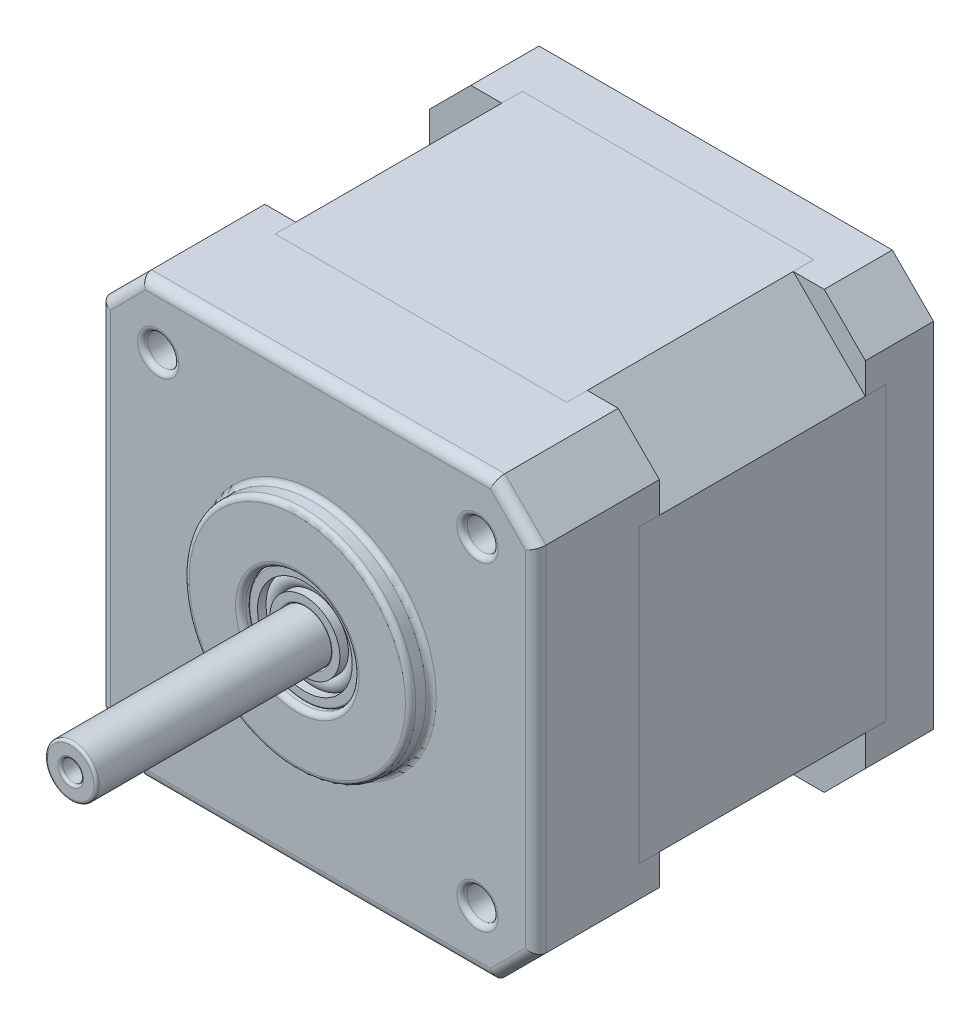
ISO-10303-21;
HEADER;
FILE_DESCRIPTION(('STEP AP214'),'2;1');
FILE_NAME('part.step','',(''),(''),'','','');
FILE_SCHEMA(('AUTOMOTIVE_DESIGN { 1 0 10303 214 1 1 1 1 }'));
ENDSEC;
DATA;
#1=APPLICATION_CONTEXT('core data for automotive mechanical design processes');
#2=APPLICATION_PROTOCOL_DEFINITION('international standard','automotive_design',2000,#1);
#3=PRODUCT_CONTEXT('',#1,'mechanical');
#4=PRODUCT('Part','Part','',(#3));
#5=PRODUCT_RELATED_PRODUCT_CATEGORY('part','',(#4));
#6=PRODUCT_DEFINITION_FORMATION('','',#4);
#7=PRODUCT_DEFINITION_CONTEXT('part definition',#1,'design');
#8=PRODUCT_DEFINITION('design','',#6,#7);
#9=PRODUCT_DEFINITION_SHAPE('','',#8);
#10=(LENGTH_UNIT() NAMED_UNIT(*) SI_UNIT(.MILLI.,.METRE.));
#11=(NAMED_UNIT(*) PLANE_ANGLE_UNIT() SI_UNIT($,.RADIAN.));
#12=(NAMED_UNIT(*) SI_UNIT($,.STERADIAN.) SOLID_ANGLE_UNIT());
#13=UNCERTAINTY_MEASURE_WITH_UNIT(LENGTH_MEASURE(1.E-05),#10,'distance_accuracy_value','');
#14=(GEOMETRIC_REPRESENTATION_CONTEXT(3) GLOBAL_UNCERTAINTY_ASSIGNED_CONTEXT((#13)) GLOBAL_UNIT_ASSIGNED_CONTEXT((#10,
#11,#12)) REPRESENTATION_CONTEXT('',''));
#15=CARTESIAN_POINT('',(0.,0.,0.));
#16=DIRECTION('',(0.,0.,1.));
#17=DIRECTION('',(1.,0.,0.));
#18=AXIS2_PLACEMENT_3D('',#15,#16,#17);
#19=CARTESIAN_POINT('',(-10.395502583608,4.61715141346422,67.9999999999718));
#20=DIRECTION('',(0.,0.,-1.));
#21=DIRECTION('',(-0.574855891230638,-0.818254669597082,0.));
#22=AXIS2_PLACEMENT_3D('',#19,#20,#21);
#23=CYLINDRICAL_SURFACE('',#22,2.5);
#24=CARTESIAN_POINT('',(-10.395502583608,4.61715141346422,5.38479999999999));
#25=DIRECTION('',(0.,0.,1.));
#26=DIRECTION('',(1.,0.,0.));
#27=AXIS2_PLACEMENT_3D('',#24,#25,#26);
#28=CIRCLE('',#27,2.5);
#29=CARTESIAN_POINT('',(-7.89550258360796,4.61715141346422,5.38479999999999));
#30=VERTEX_POINT('',#29);
#31=EDGE_CURVE('P0_E45',#30,#30,#28,.T.);
#32=ORIENTED_EDGE('',*,*,#31,.T.);
#33=EDGE_LOOP('',(#32));
#34=FACE_BOUND('',#33,.T.);
#35=CARTESIAN_POINT('',(-10.395502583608,4.61715141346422,67.7499999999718));
#36=DIRECTION('',(0.,0.,1.));
#37=DIRECTION('',(0.574855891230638,0.818254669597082,0.));
#38=AXIS2_PLACEMENT_3D('',#35,#36,#37);
#39=CIRCLE('',#38,2.5);
#40=CARTESIAN_POINT('',(-8.95836285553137,6.66278808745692,67.7499999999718));
#41=VERTEX_POINT('',#40);
#42=EDGE_CURVE('P0_E49',#41,#41,#39,.F.);
#43=ORIENTED_EDGE('',*,*,#42,.T.);
#44=EDGE_LOOP('',(#43));
#45=FACE_BOUND('',#44,.T.);
#46=ADVANCED_FACE('P0_F41',(#34,#45),#23,.T.);
#47=CARTESIAN_POINT('',(-10.395502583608,4.61715141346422,67.9999999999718));
#48=DIRECTION('',(0.,0.,1.));
#49=DIRECTION('',(0.574855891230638,0.818254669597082,0.));
#50=AXIS2_PLACEMENT_3D('',#47,#48,#49);
#51=PLANE('',#50);
#52=CARTESIAN_POINT('',(-10.395502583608,4.61715141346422,67.9999999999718));
#53=DIRECTION('',(0.,0.,1.));
#54=DIRECTION('',(0.574855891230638,0.818254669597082,0.));
#55=AXIS2_PLACEMENT_3D('',#52,#53,#54);
#56=CIRCLE('',#55,2.25);
#57=CARTESIAN_POINT('',(-9.10207682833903,6.45822442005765,67.9999999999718));
#58=VERTEX_POINT('',#57);
#59=EDGE_CURVE('P0_E53',#58,#58,#56,.T.);
#60=ORIENTED_EDGE('',*,*,#59,.T.);
#61=EDGE_LOOP('',(#60));
#62=FACE_BOUND('',#61,.T.);
#63=CARTESIAN_POINT('',(-10.395502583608,4.61715141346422,67.9999999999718));
#64=DIRECTION('',(0.,0.,1.));
#65=DIRECTION('',(0.574855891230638,0.818254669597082,0.));
#66=AXIS2_PLACEMENT_3D('',#63,#64,#65);
#67=CIRCLE('',#66,1.25);
#68=CARTESIAN_POINT('',(-9.67693271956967,5.63996975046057,67.9999999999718));
#69=VERTEX_POINT('',#68);
#70=EDGE_CURVE('P0_E58',#69,#69,#67,.F.);
#71=ORIENTED_EDGE('',*,*,#70,.T.);
#72=EDGE_LOOP('',(#71));
#73=FACE_BOUND('',#72,.T.);
#74=ADVANCED_FACE('P0_F81',(#62,#73),#51,.T.);
#75=CARTESIAN_POINT('',(-10.395502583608,4.61715141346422,57.9999999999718));
#76=DIRECTION('',(0.,0.,1.));
#77=DIRECTION('',(0.574855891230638,0.818254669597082,0.));
#78=AXIS2_PLACEMENT_3D('',#75,#76,#77);
#79=CYLINDRICAL_SURFACE('',#78,1.);
#80=CARTESIAN_POINT('',(-10.395502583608,4.61715141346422,67.7499999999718));
#81=DIRECTION('',(0.,0.,1.));
#82=DIRECTION('',(0.574855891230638,0.818254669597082,0.));
#83=AXIS2_PLACEMENT_3D('',#80,#81,#82);
#84=CIRCLE('',#83,1.);
#85=CARTESIAN_POINT('',(-9.82064669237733,5.4354060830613,67.7499999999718));
#86=VERTEX_POINT('',#85);
#87=EDGE_CURVE('P0_E11',#86,#86,#84,.T.);
#88=ORIENTED_EDGE('',*,*,#87,.T.);
#89=EDGE_LOOP('',(#88));
#90=FACE_BOUND('',#89,.T.);
#91=CARTESIAN_POINT('',(-10.395502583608,4.61715141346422,57.9999999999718));
#92=DIRECTION('',(0.,0.,1.));
#93=DIRECTION('',(0.574855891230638,0.818254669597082,0.));
#94=AXIS2_PLACEMENT_3D('',#91,#92,#93);
#95=CIRCLE('',#94,1.);
#96=CARTESIAN_POINT('',(-9.82064669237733,5.4354060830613,57.9999999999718));
#97=VERTEX_POINT('',#96);
#98=EDGE_CURVE('P0_E61',#97,#97,#95,.T.);
#99=ORIENTED_EDGE('',*,*,#98,.F.);
#100=EDGE_LOOP('',(#99));
#101=FACE_BOUND('',#100,.T.);
#102=ADVANCED_FACE('P0_F86',(#90,#101),#79,.F.);
#103=CARTESIAN_POINT('',(-10.395502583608,4.61715141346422,57.9999999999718));
#104=DIRECTION('',(0.,0.,1.));
#105=DIRECTION('',(0.574855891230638,0.818254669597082,0.));
#106=AXIS2_PLACEMENT_3D('',#103,#104,#105);
#107=PLANE('',#106);
#108=ORIENTED_EDGE('',*,*,#98,.T.);
#109=EDGE_LOOP('',(#108));
#110=FACE_BOUND('',#109,.T.);
#111=ADVANCED_FACE('P0_F91',(#110),#107,.T.);
#112=CARTESIAN_POINT('',(-10.395502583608,4.61715141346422,67.7499999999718));
#113=DIRECTION('',(0.,0.,1.));
#114=DIRECTION('',(0.574855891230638,0.818254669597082,0.));
#115=AXIS2_PLACEMENT_3D('',#112,#113,#114);
#116=TOROIDAL_SURFACE('',#115,2.25,0.25);
#117=ORIENTED_EDGE('',*,*,#42,.F.);
#118=EDGE_LOOP('',(#117));
#119=FACE_BOUND('',#118,.T.);
#120=ORIENTED_EDGE('',*,*,#59,.F.);
#121=EDGE_LOOP('',(#120));
#122=FACE_BOUND('',#121,.T.);
#123=ADVANCED_FACE('P0_F77',(#119,#122),#116,.T.);
#124=CARTESIAN_POINT('',(-10.395502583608,4.61715141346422,67.7499999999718));
#125=DIRECTION('',(0.,0.,1.));
#126=DIRECTION('',(0.574855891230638,0.818254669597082,0.));
#127=AXIS2_PLACEMENT_3D('',#124,#125,#126);
#128=TOROIDAL_SURFACE('',#127,1.25,0.25);
#129=ORIENTED_EDGE('',*,*,#70,.F.);
#130=EDGE_LOOP('',(#129));
#131=FACE_BOUND('',#130,.T.);
#132=ORIENTED_EDGE('',*,*,#87,.F.);
#133=EDGE_LOOP('',(#132));
#134=FACE_BOUND('',#133,.T.);
#135=ADVANCED_FACE('P0_F43',(#131,#134),#128,.T.);
#136=CARTESIAN_POINT('',(0.,0.,5.3848));
#137=DIRECTION('',(0.,0.,1.));
#138=DIRECTION('',(1.,0.,0.));
#139=AXIS2_PLACEMENT_3D('',#136,#137,#138);
#140=PLANE('',#139);
#141=ORIENTED_EDGE('',*,*,#31,.F.);
#142=EDGE_LOOP('',(#141));
#143=FACE_BOUND('',#142,.T.);
#144=ADVANCED_FACE('P0_F70',(#143),#140,.F.);
#145=CLOSED_SHELL('',(#46,#74,#102,#111,#123,#135,#144));
#146=MANIFOLD_SOLID_BREP('P0_B2',#145);
#147=CARTESIAN_POINT('',(5.10449741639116,-10.8828485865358,-24.8000000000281));
#148=DIRECTION('',(0.,0.,-1.));
#149=DIRECTION('',(-0.883632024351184,0.468182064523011,0.));
#150=AXIS2_PLACEMENT_3D('',#147,#148,#149);
#151=CYLINDRICAL_SURFACE('',#150,1.5);
#152=CARTESIAN_POINT('',(5.10449741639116,-10.8828485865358,5.3848));
#153=DIRECTION('',(0.,0.,1.));
#154=DIRECTION('',(1.,0.,0.));
#155=AXIS2_PLACEMENT_3D('',#152,#153,#154);
#156=CIRCLE('',#155,1.5);
#157=CARTESIAN_POINT('',(6.60449741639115,-10.8828485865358,5.3848));
#158=VERTEX_POINT('',#157);
#159=EDGE_CURVE('P0_E170',#158,#158,#156,.F.);
#160=ORIENTED_EDGE('',*,*,#159,.F.);
#161=EDGE_LOOP('',(#160));
#162=FACE_BOUND('',#161,.T.);
#163=CARTESIAN_POINT('',(5.10449741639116,-10.8828485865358,7.99999999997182));
#164=DIRECTION('',(0.,0.,-1.));
#165=DIRECTION('',(-0.883632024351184,0.468182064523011,0.));
#166=AXIS2_PLACEMENT_3D('',#163,#164,#165);
#167=CIRCLE('',#166,1.5);
#168=CARTESIAN_POINT('',(3.77904937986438,-10.1805754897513,7.99999999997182));
#169=VERTEX_POINT('',#168);
#170=EDGE_CURVE('P0_E40',#169,#169,#167,.T.);
#171=ORIENTED_EDGE('',*,*,#170,.T.);
#172=EDGE_LOOP('',(#171));
#173=FACE_BOUND('',#172,.T.);
#174=ADVANCED_FACE('P0_F167',(#162,#173),#151,.T.);
#175=CARTESIAN_POINT('',(5.80677051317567,-9.55740055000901,7.99999999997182));
#176=DIRECTION('',(0.,0.,1.));
#177=DIRECTION('',(0.883632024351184,-0.468182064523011,0.));
#178=AXIS2_PLACEMENT_3D('',#175,#176,#177);
#179=PLANE('',#178);
#180=ORIENTED_EDGE('',*,*,#170,.F.);
#181=EDGE_LOOP('',(#180));
#182=FACE_BOUND('',#181,.T.);
#183=ADVANCED_FACE('P0_F182',(#182),#179,.T.);
#184=CARTESIAN_POINT('',(0.,0.,5.3848));
#185=DIRECTION('',(0.,0.,1.));
#186=DIRECTION('',(1.,0.,0.));
#187=AXIS2_PLACEMENT_3D('',#184,#185,#186);
#188=PLANE('',#187);
#189=ORIENTED_EDGE('',*,*,#159,.T.);
#190=EDGE_LOOP('',(#189));
#191=FACE_BOUND('',#190,.T.);
#192=ADVANCED_FACE('P0_F179',(#191),#188,.F.);
#193=CLOSED_SHELL('',(#174,#183,#192));
#194=MANIFOLD_SOLID_BREP('P0_B6',#193);
#195=CARTESIAN_POINT('',(-25.8955025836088,-10.8828485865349,-24.8000000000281));
#196=DIRECTION('',(0.,0.,-1.));
#197=DIRECTION('',(-0.913850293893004,-0.406051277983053,0.));
#198=AXIS2_PLACEMENT_3D('',#195,#196,#197);
#199=CYLINDRICAL_SURFACE('',#198,1.5);
#200=CARTESIAN_POINT('',(-25.8955025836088,-10.8828485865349,5.3848));
#201=DIRECTION('',(0.,0.,1.));
#202=DIRECTION('',(1.,0.,0.));
#203=AXIS2_PLACEMENT_3D('',#200,#201,#202);
#204=CIRCLE('',#203,1.5);
#205=CARTESIAN_POINT('',(-24.3955025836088,-10.8828485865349,5.3848));
#206=VERTEX_POINT('',#205);
#207=EDGE_CURVE('P0_E224',#206,#206,#204,.F.);
#208=ORIENTED_EDGE('',*,*,#207,.F.);
#209=EDGE_LOOP('',(#208));
#210=FACE_BOUND('',#209,.T.);
#211=CARTESIAN_POINT('',(-25.8955025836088,-10.8828485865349,7.99999999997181));
#212=DIRECTION('',(0.,0.,-1.));
#213=DIRECTION('',(-0.913850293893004,-0.406051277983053,0.));
#214=AXIS2_PLACEMENT_3D('',#211,#212,#213);
#215=CIRCLE('',#214,1.5);
#216=CARTESIAN_POINT('',(-27.2662780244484,-11.4919255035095,7.99999999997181));
#217=VERTEX_POINT('',#216);
#218=EDGE_CURVE('P0_E166',#217,#217,#215,.T.);
#219=ORIENTED_EDGE('',*,*,#218,.T.);
#220=EDGE_LOOP('',(#219));
#221=FACE_BOUND('',#220,.T.);
#222=ADVANCED_FACE('P0_F221',(#210,#221),#199,.T.);
#223=CARTESIAN_POINT('',(-26.5045795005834,-9.5120731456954,7.99999999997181));
#224=DIRECTION('',(0.,0.,1.));
#225=DIRECTION('',(0.913850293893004,0.406051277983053,0.));
#226=AXIS2_PLACEMENT_3D('',#223,#224,#225);
#227=PLANE('',#226);
#228=ORIENTED_EDGE('',*,*,#218,.F.);
#229=EDGE_LOOP('',(#228));
#230=FACE_BOUND('',#229,.T.);
#231=ADVANCED_FACE('P0_F236',(#230),#227,.T.);
#232=CARTESIAN_POINT('',(0.,0.,5.3848));
#233=DIRECTION('',(0.,0.,1.));
#234=DIRECTION('',(1.,0.,0.));
#235=AXIS2_PLACEMENT_3D('',#232,#233,#234);
#236=PLANE('',#235);
#237=ORIENTED_EDGE('',*,*,#207,.T.);
#238=EDGE_LOOP('',(#237));
#239=FACE_BOUND('',#238,.T.);
#240=ADVANCED_FACE('P0_F233',(#239),#236,.F.);
#241=CLOSED_SHELL('',(#222,#231,#240));
#242=MANIFOLD_SOLID_BREP('P0_B35',#241);
#243=CARTESIAN_POINT('',(-25.895502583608,20.1171514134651,-24.8000000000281));
#244=DIRECTION('',(0.,0.,-1.));
#245=DIRECTION('',(-0.859432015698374,0.511250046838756,0.));
#246=AXIS2_PLACEMENT_3D('',#243,#244,#245);
#247=CYLINDRICAL_SURFACE('',#246,1.5);
#248=CARTESIAN_POINT('',(-25.895502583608,20.1171514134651,5.3848));
#249=DIRECTION('',(0.,0.,1.));
#250=DIRECTION('',(1.,0.,0.));
#251=AXIS2_PLACEMENT_3D('',#248,#249,#250);
#252=CIRCLE('',#251,1.5);
#253=CARTESIAN_POINT('',(-24.395502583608,20.1171514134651,5.3848));
#254=VERTEX_POINT('',#253);
#255=EDGE_CURVE('P0_E278',#254,#254,#252,.F.);
#256=ORIENTED_EDGE('',*,*,#255,.F.);
#257=EDGE_LOOP('',(#256));
#258=FACE_BOUND('',#257,.T.);
#259=CARTESIAN_POINT('',(-25.895502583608,20.1171514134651,7.99999999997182));
#260=DIRECTION('',(0.,0.,-1.));
#261=DIRECTION('',(-0.859432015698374,0.511250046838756,0.));
#262=AXIS2_PLACEMENT_3D('',#259,#260,#261);
#263=CIRCLE('',#262,1.5);
#264=CARTESIAN_POINT('',(-27.1846506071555,20.8840264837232,7.99999999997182));
#265=VERTEX_POINT('',#264);
#266=EDGE_CURVE('P0_E220',#265,#265,#263,.T.);
#267=ORIENTED_EDGE('',*,*,#266,.T.);
#268=EDGE_LOOP('',(#267));
#269=FACE_BOUND('',#268,.T.);
#270=ADVANCED_FACE('P0_F275',(#258,#269),#247,.T.);
#271=CARTESIAN_POINT('',(-25.1286275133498,21.4062994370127,7.99999999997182));
#272=DIRECTION('',(0.,0.,1.));
#273=DIRECTION('',(0.859432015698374,-0.511250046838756,0.));
#274=AXIS2_PLACEMENT_3D('',#271,#272,#273);
#275=PLANE('',#274);
#276=ORIENTED_EDGE('',*,*,#266,.F.);
#277=EDGE_LOOP('',(#276));
#278=FACE_BOUND('',#277,.T.);
#279=ADVANCED_FACE('P0_F290',(#278),#275,.T.);
#280=CARTESIAN_POINT('',(0.,0.,5.3848));
#281=DIRECTION('',(0.,0.,1.));
#282=DIRECTION('',(1.,0.,0.));
#283=AXIS2_PLACEMENT_3D('',#280,#281,#282);
#284=PLANE('',#283);
#285=ORIENTED_EDGE('',*,*,#255,.T.);
#286=EDGE_LOOP('',(#285));
#287=FACE_BOUND('',#286,.T.);
#288=ADVANCED_FACE('P0_F287',(#287),#284,.F.);
#289=CLOSED_SHELL('',(#270,#279,#288));
#290=MANIFOLD_SOLID_BREP('P0_B161',#289);
#291=CARTESIAN_POINT('',(5.10449741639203,20.1171514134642,-24.8000000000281));
#292=DIRECTION('',(0.,0.,-1.));
#293=DIRECTION('',(-0.896000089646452,0.444053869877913,0.));
#294=AXIS2_PLACEMENT_3D('',#291,#292,#293);
#295=CYLINDRICAL_SURFACE('',#294,1.5);
#296=CARTESIAN_POINT('',(5.10449741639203,20.1171514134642,5.3848));
#297=DIRECTION('',(0.,0.,1.));
#298=DIRECTION('',(1.,0.,0.));
#299=AXIS2_PLACEMENT_3D('',#296,#297,#298);
#300=CIRCLE('',#299,1.5);
#301=CARTESIAN_POINT('',(6.60449741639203,20.1171514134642,5.3848));
#302=VERTEX_POINT('',#301);
#303=EDGE_CURVE('P0_E333',#302,#302,#300,.F.);
#304=ORIENTED_EDGE('',*,*,#303,.F.);
#305=EDGE_LOOP('',(#304));
#306=FACE_BOUND('',#305,.T.);
#307=CARTESIAN_POINT('',(5.10449741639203,20.1171514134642,7.99999999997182));
#308=DIRECTION('',(0.,0.,-1.));
#309=DIRECTION('',(-0.896000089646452,0.444053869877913,0.));
#310=AXIS2_PLACEMENT_3D('',#307,#308,#309);
#311=CIRCLE('',#310,1.5);
#312=CARTESIAN_POINT('',(3.76049728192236,20.7832322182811,7.99999999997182));
#313=VERTEX_POINT('',#312);
#314=EDGE_CURVE('P0_E274',#313,#313,#311,.T.);
#315=ORIENTED_EDGE('',*,*,#314,.T.);
#316=EDGE_LOOP('',(#315));
#317=FACE_BOUND('',#316,.T.);
#318=ADVANCED_FACE('P0_F330',(#306,#317),#295,.T.);
#319=CARTESIAN_POINT('',(5.7705782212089,21.4611515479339,7.99999999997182));
#320=DIRECTION('',(0.,0.,1.));
#321=DIRECTION('',(0.896000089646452,-0.444053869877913,0.));
#322=AXIS2_PLACEMENT_3D('',#319,#320,#321);
#323=PLANE('',#322);
#324=ORIENTED_EDGE('',*,*,#314,.F.);
#325=EDGE_LOOP('',(#324));
#326=FACE_BOUND('',#325,.T.);
#327=ADVANCED_FACE('P0_F345',(#326),#323,.T.);
#328=CARTESIAN_POINT('',(0.,0.,5.3848));
#329=DIRECTION('',(0.,0.,1.));
#330=DIRECTION('',(1.,0.,0.));
#331=AXIS2_PLACEMENT_3D('',#328,#329,#330);
#332=PLANE('',#331);
#333=ORIENTED_EDGE('',*,*,#303,.T.);
#334=EDGE_LOOP('',(#333));
#335=FACE_BOUND('',#334,.T.);
#336=ADVANCED_FACE('P0_F342',(#335),#332,.F.);
#337=CLOSED_SHELL('',(#318,#327,#336));
#338=MANIFOLD_SOLID_BREP('P0_B215',#337);
#339=CARTESIAN_POINT('',(5.10449741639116,-10.8828485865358,21.9999999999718));
#340=DIRECTION('',(0.,0.,-1.));
#341=DIRECTION('',(-1.,0.,0.));
#342=AXIS2_PLACEMENT_3D('',#339,#340,#341);
#343=CYLINDRICAL_SURFACE('',#342,1.50000000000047);
#344=CARTESIAN_POINT('',(5.10449741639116,-10.8828485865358,5.3848));
#345=DIRECTION('',(0.,0.,1.));
#346=DIRECTION('',(1.,0.,0.));
#347=AXIS2_PLACEMENT_3D('',#344,#345,#346);
#348=CIRCLE('',#347,1.50000000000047);
#349=CARTESIAN_POINT('',(6.60449741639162,-10.8828485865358,5.3848));
#350=VERTEX_POINT('',#349);
#351=EDGE_CURVE('P0_E545',#350,#350,#348,.F.);
#352=ORIENTED_EDGE('',*,*,#351,.T.);
#353=EDGE_LOOP('',(#352));
#354=FACE_BOUND('',#353,.T.);
#355=CARTESIAN_POINT('',(5.10449741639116,-10.8828485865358,9.99999999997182));
#356=DIRECTION('',(0.,0.,-1.));
#357=DIRECTION('',(-1.,0.,0.));
#358=AXIS2_PLACEMENT_3D('',#355,#356,#357);
#359=CIRCLE('',#358,1.50000000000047);
#360=CARTESIAN_POINT('',(3.60449741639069,-10.8828485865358,9.99999999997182));
#361=VERTEX_POINT('',#360);
#362=EDGE_CURVE('P0_E539',#361,#361,#359,.T.);
#363=ORIENTED_EDGE('',*,*,#362,.F.);
#364=EDGE_LOOP('',(#363));
#365=FACE_BOUND('',#364,.T.);
#366=ADVANCED_FACE('P0_F376',(#354,#365),#343,.F.);
#367=CARTESIAN_POINT('',(-25.8955025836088,-10.8828485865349,21.9999999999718));
#368=DIRECTION('',(0.,0.,-1.));
#369=DIRECTION('',(-1.,0.,0.));
#370=AXIS2_PLACEMENT_3D('',#367,#368,#369);
#371=CYLINDRICAL_SURFACE('',#370,1.50000000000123);
#372=CARTESIAN_POINT('',(-25.8955025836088,-10.8828485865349,5.3848));
#373=DIRECTION('',(0.,0.,1.));
#374=DIRECTION('',(1.,0.,0.));
#375=AXIS2_PLACEMENT_3D('',#372,#373,#374);
#376=CIRCLE('',#375,1.50000000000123);
#377=CARTESIAN_POINT('',(-24.3955025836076,-10.8828485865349,5.3848));
#378=VERTEX_POINT('',#377);
#379=EDGE_CURVE('P0_E550',#378,#378,#376,.F.);
#380=ORIENTED_EDGE('',*,*,#379,.T.);
#381=EDGE_LOOP('',(#380));
#382=FACE_BOUND('',#381,.T.);
#383=CARTESIAN_POINT('',(-25.8955025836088,-10.8828485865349,9.99999999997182));
#384=DIRECTION('',(0.,0.,-1.));
#385=DIRECTION('',(-1.,0.,0.));
#386=AXIS2_PLACEMENT_3D('',#383,#384,#385);
#387=CIRCLE('',#386,1.50000000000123);
#388=CARTESIAN_POINT('',(-27.3955025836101,-10.8828485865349,9.99999999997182));
#389=VERTEX_POINT('',#388);
#390=EDGE_CURVE('P0_E537',#389,#389,#387,.T.);
#391=ORIENTED_EDGE('',*,*,#390,.F.);
#392=EDGE_LOOP('',(#391));
#393=FACE_BOUND('',#392,.T.);
#394=ADVANCED_FACE('P0_F663',(#382,#393),#371,.F.);
#395=CARTESIAN_POINT('',(-25.895502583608,20.1171514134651,21.9999999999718));
#396=DIRECTION('',(0.,0.,-1.));
#397=DIRECTION('',(-1.,0.,0.));
#398=AXIS2_PLACEMENT_3D('',#395,#396,#397);
#399=CYLINDRICAL_SURFACE('',#398,1.50000000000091);
#400=CARTESIAN_POINT('',(-25.895502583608,20.1171514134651,5.3848));
#401=DIRECTION('',(0.,0.,1.));
#402=DIRECTION('',(1.,0.,0.));
#403=AXIS2_PLACEMENT_3D('',#400,#401,#402);
#404=CIRCLE('',#403,1.50000000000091);
#405=CARTESIAN_POINT('',(-24.3955025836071,20.1171514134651,5.3848));
#406=VERTEX_POINT('',#405);
#407=EDGE_CURVE('P0_E658',#406,#406,#404,.F.);
#408=ORIENTED_EDGE('',*,*,#407,.T.);
#409=EDGE_LOOP('',(#408));
#410=FACE_BOUND('',#409,.T.);
#411=CARTESIAN_POINT('',(-25.895502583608,20.1171514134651,9.99999999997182));
#412=DIRECTION('',(0.,0.,-1.));
#413=DIRECTION('',(-1.,0.,0.));
#414=AXIS2_PLACEMENT_3D('',#411,#412,#413);
#415=CIRCLE('',#414,1.50000000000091);
#416=CARTESIAN_POINT('',(-27.3955025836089,20.1171514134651,9.99999999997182));
#417=VERTEX_POINT('',#416);
#418=EDGE_CURVE('P0_E534',#417,#417,#415,.T.);
#419=ORIENTED_EDGE('',*,*,#418,.F.);
#420=EDGE_LOOP('',(#419));
#421=FACE_BOUND('',#420,.T.);
#422=ADVANCED_FACE('P0_F675',(#410,#421),#399,.F.);
#423=CARTESIAN_POINT('',(5.10449741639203,20.1171514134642,21.9999999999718));
#424=DIRECTION('',(0.,0.,-1.));
#425=DIRECTION('',(-1.,0.,0.));
#426=AXIS2_PLACEMENT_3D('',#423,#424,#425);
#427=CYLINDRICAL_SURFACE('',#426,1.5);
#428=CARTESIAN_POINT('',(5.10449741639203,20.1171514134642,5.3848));
#429=DIRECTION('',(0.,0.,1.));
#430=DIRECTION('',(1.,0.,0.));
#431=AXIS2_PLACEMENT_3D('',#428,#429,#430);
#432=CIRCLE('',#431,1.5);
#433=CARTESIAN_POINT('',(6.60449741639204,20.1171514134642,5.3848));
#434=VERTEX_POINT('',#433);
#435=EDGE_CURVE('P0_E655',#434,#434,#432,.F.);
#436=ORIENTED_EDGE('',*,*,#435,.T.);
#437=EDGE_LOOP('',(#436));
#438=FACE_BOUND('',#437,.T.);
#439=CARTESIAN_POINT('',(5.10449741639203,20.1171514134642,9.99999999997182));
#440=DIRECTION('',(0.,0.,-1.));
#441=DIRECTION('',(-1.,0.,0.));
#442=AXIS2_PLACEMENT_3D('',#439,#440,#441);
#443=CIRCLE('',#442,1.5);
#444=CARTESIAN_POINT('',(3.60449741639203,20.1171514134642,9.99999999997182));
#445=VERTEX_POINT('',#444);
#446=EDGE_CURVE('P0_E530',#445,#445,#443,.T.);
#447=ORIENTED_EDGE('',*,*,#446,.F.);
#448=EDGE_LOOP('',(#447));
#449=FACE_BOUND('',#448,.T.);
#450=ADVANCED_FACE('P0_F672',(#438,#449),#427,.F.);
#451=CARTESIAN_POINT('',(-10.395502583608,4.61715141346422,11.9999999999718));
#452=DIRECTION('',(0.,0.,1.));
#453=DIRECTION('',(1.,0.,0.));
#454=AXIS2_PLACEMENT_3D('',#451,#452,#453);
#455=PLANE('',#454);
#456=DIRECTION('',(-0.707106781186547,0.707106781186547,0.));
#457=VECTOR('',#456,1.);
#458=CARTESIAN_POINT('',(3.75449741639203,25.7671514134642,11.9999999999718));
#459=LINE('',#458,#457);
#460=CARTESIAN_POINT('',(10.754497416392,18.7671514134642,11.9999999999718));
#461=VERTEX_POINT('',#460);
#462=CARTESIAN_POINT('',(3.75449741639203,25.7671514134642,11.9999999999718));
#463=VERTEX_POINT('',#462);
#464=EDGE_CURVE('P0_E558',#461,#463,#459,.T.);
#465=ORIENTED_EDGE('',*,*,#464,.F.);
#466=DIRECTION('',(0.,1.,0.));
#467=VECTOR('',#466,1.);
#468=CARTESIAN_POINT('',(10.754497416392,21.7671514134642,11.9999999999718));
#469=LINE('',#468,#467);
#470=CARTESIAN_POINT('',(10.754497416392,21.7671514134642,11.9999999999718));
#471=VERTEX_POINT('',#470);
#472=EDGE_CURVE('P0_E615',#461,#471,#469,.T.);
#473=ORIENTED_EDGE('',*,*,#472,.T.);
#474=DIRECTION('',(-0.707106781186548,0.707106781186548,0.));
#475=VECTOR('',#474,1.);
#476=CARTESIAN_POINT('',(6.75449741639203,25.7671514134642,11.9999999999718));
#477=LINE('',#476,#475);
#478=CARTESIAN_POINT('',(6.75449741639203,25.7671514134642,11.9999999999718));
#479=VERTEX_POINT('',#478);
#480=EDGE_CURVE('P0_E619',#471,#479,#477,.T.);
#481=ORIENTED_EDGE('',*,*,#480,.T.);
#482=DIRECTION('',(-1.,0.,0.));
#483=VECTOR('',#482,1.);
#484=CARTESIAN_POINT('',(-27.545502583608,25.7671514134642,11.9999999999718));
#485=LINE('',#484,#483);
#486=EDGE_CURVE('P0_E622',#479,#463,#485,.T.);
#487=ORIENTED_EDGE('',*,*,#486,.T.);
#488=EDGE_LOOP('',(#465,#473,#481,#487));
#489=FACE_BOUND('',#488,.T.);
#490=ADVANCED_FACE('P0_F638',(#489),#455,.T.);
#491=DIRECTION('',(0.707106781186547,0.707106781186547,0.));
#492=VECTOR('',#491,1.);
#493=CARTESIAN_POINT('',(3.75449741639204,-16.5328485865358,11.9999999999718));
#494=LINE('',#493,#492);
#495=CARTESIAN_POINT('',(3.75449741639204,-16.5328485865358,11.9999999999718));
#496=VERTEX_POINT('',#495);
#497=CARTESIAN_POINT('',(10.754497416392,-9.53284858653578,11.9999999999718));
#498=VERTEX_POINT('',#497);
#499=EDGE_CURVE('P0_E581',#496,#498,#494,.T.);
#500=ORIENTED_EDGE('',*,*,#499,.F.);
#501=DIRECTION('',(1.,0.,0.));
#502=VECTOR('',#501,1.);
#503=CARTESIAN_POINT('',(-27.545502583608,-16.5328485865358,11.9999999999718));
#504=LINE('',#503,#502);
#505=CARTESIAN_POINT('',(6.75449741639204,-16.5328485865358,11.9999999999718));
#506=VERTEX_POINT('',#505);
#507=EDGE_CURVE('P0_E609',#496,#506,#504,.T.);
#508=ORIENTED_EDGE('',*,*,#507,.T.);
#509=DIRECTION('',(0.707106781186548,0.707106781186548,0.));
#510=VECTOR('',#509,1.);
#511=CARTESIAN_POINT('',(6.75449741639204,-16.5328485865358,11.9999999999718));
#512=LINE('',#511,#510);
#513=CARTESIAN_POINT('',(10.754497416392,-12.5328485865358,11.9999999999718));
#514=VERTEX_POINT('',#513);
#515=EDGE_CURVE('P0_E613',#506,#514,#512,.T.);
#516=ORIENTED_EDGE('',*,*,#515,.T.);
#517=EDGE_CURVE('P0_E616',#514,#498,#469,.T.);
#518=ORIENTED_EDGE('',*,*,#517,.T.);
#519=EDGE_LOOP('',(#500,#508,#516,#518));
#520=FACE_BOUND('',#519,.T.);
#521=ADVANCED_FACE('P0_F884',(#520),#455,.T.);
#522=DIRECTION('',(0.707106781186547,-0.707106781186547,0.));
#523=VECTOR('',#522,1.);
#524=CARTESIAN_POINT('',(-31.545502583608,-9.53284858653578,11.9999999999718));
#525=LINE('',#524,#523);
#526=CARTESIAN_POINT('',(-31.545502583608,-9.53284858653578,11.9999999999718));
#527=VERTEX_POINT('',#526);
#528=CARTESIAN_POINT('',(-24.545502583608,-16.5328485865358,11.9999999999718));
#529=VERTEX_POINT('',#528);
#530=EDGE_CURVE('P0_E579',#527,#529,#525,.T.);
#531=ORIENTED_EDGE('',*,*,#530,.F.);
#532=DIRECTION('',(0.,-1.,0.));
#533=VECTOR('',#532,1.);
#534=CARTESIAN_POINT('',(-31.545502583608,21.7671514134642,11.9999999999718));
#535=LINE('',#534,#533);
#536=CARTESIAN_POINT('',(-31.545502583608,-12.5328485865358,11.9999999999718));
#537=VERTEX_POINT('',#536);
#538=EDGE_CURVE('P0_E587',#527,#537,#535,.T.);
#539=ORIENTED_EDGE('',*,*,#538,.T.);
#540=DIRECTION('',(0.707106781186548,-0.707106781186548,0.));
#541=VECTOR('',#540,1.);
#542=CARTESIAN_POINT('',(-31.545502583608,-12.5328485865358,11.9999999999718));
#543=LINE('',#542,#541);
#544=CARTESIAN_POINT('',(-27.545502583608,-16.5328485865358,11.9999999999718));
#545=VERTEX_POINT('',#544);
#546=EDGE_CURVE('P0_E607',#537,#545,#543,.T.);
#547=ORIENTED_EDGE('',*,*,#546,.T.);
#548=EDGE_CURVE('P0_E610',#545,#529,#504,.T.);
#549=ORIENTED_EDGE('',*,*,#548,.T.);
#550=EDGE_LOOP('',(#531,#539,#547,#549));
#551=FACE_BOUND('',#550,.T.);
#552=ADVANCED_FACE('P0_F728',(#551),#455,.T.);
#553=CARTESIAN_POINT('',(-31.545502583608,21.7671514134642,11.9999999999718));
#554=DIRECTION('',(1.,0.,0.));
#555=DIRECTION('',(0.,1.,0.));
#556=AXIS2_PLACEMENT_3D('',#553,#554,#555);
#557=PLANE('',#556);
#558=DIRECTION('',(0.,0.,-1.));
#559=VECTOR('',#558,1.);
#560=CARTESIAN_POINT('',(-31.545502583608,21.7671514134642,11.9999999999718));
#561=LINE('',#560,#559);
#562=CARTESIAN_POINT('',(-31.545502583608,21.7671514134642,11.9999999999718));
#563=VERTEX_POINT('',#562);
#564=CARTESIAN_POINT('',(-31.545502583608,21.7671514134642,5.3848));
#565=VERTEX_POINT('',#564);
#566=EDGE_CURVE('P0_E513',#563,#565,#561,.T.);
#567=ORIENTED_EDGE('',*,*,#566,.T.);
#568=DIRECTION('',(0.,1.,0.));
#569=VECTOR('',#568,1.);
#570=CARTESIAN_POINT('',(-31.545502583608,21.7671514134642,5.3848));
#571=LINE('',#570,#569);
#572=CARTESIAN_POINT('',(-31.545502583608,-12.5328485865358,5.3848));
#573=VERTEX_POINT('',#572);
#574=EDGE_CURVE('P0_E393',#573,#565,#571,.T.);
#575=ORIENTED_EDGE('',*,*,#574,.F.);
#576=DIRECTION('',(0.,0.,-1.));
#577=VECTOR('',#576,1.);
#578=CARTESIAN_POINT('',(-31.545502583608,-12.5328485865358,11.9999999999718));
#579=LINE('',#578,#577);
#580=EDGE_CURVE('P0_E328',#537,#573,#579,.T.);
#581=ORIENTED_EDGE('',*,*,#580,.F.);
#582=ORIENTED_EDGE('',*,*,#538,.F.);
#583=DIRECTION('',(0.,0.,1.));
#584=VECTOR('',#583,1.);
#585=CARTESIAN_POINT('',(-31.545502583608,-9.53284858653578,9.99999999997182));
#586=LINE('',#585,#584);
#587=CARTESIAN_POINT('',(-31.545502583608,-9.53284858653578,9.99999999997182));
#588=VERTEX_POINT('',#587);
#589=EDGE_CURVE('P0_E598',#588,#527,#586,.T.);
#590=ORIENTED_EDGE('',*,*,#589,.F.);
#591=DIRECTION('',(0.,-1.,0.));
#592=VECTOR('',#591,1.);
#593=CARTESIAN_POINT('',(-31.545502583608,18.7671514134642,9.99999999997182));
#594=LINE('',#593,#592);
#595=CARTESIAN_POINT('',(-31.545502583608,18.7671514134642,9.99999999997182));
#596=VERTEX_POINT('',#595);
#597=EDGE_CURVE('P0_E561',#596,#588,#594,.T.);
#598=ORIENTED_EDGE('',*,*,#597,.F.);
#599=DIRECTION('',(0.,0.,1.));
#600=VECTOR('',#599,1.);
#601=CARTESIAN_POINT('',(-31.545502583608,18.7671514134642,9.99999999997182));
#602=LINE('',#601,#600);
#603=CARTESIAN_POINT('',(-31.545502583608,18.7671514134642,11.9999999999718));
#604=VERTEX_POINT('',#603);
#605=EDGE_CURVE('P0_E600',#596,#604,#602,.T.);
#606=ORIENTED_EDGE('',*,*,#605,.T.);
#607=EDGE_CURVE('P0_E604',#563,#604,#535,.T.);
#608=ORIENTED_EDGE('',*,*,#607,.F.);
#609=EDGE_LOOP('',(#567,#575,#581,#582,#590,#598,#606,#608));
#610=FACE_BOUND('',#609,.T.);
#611=ADVANCED_FACE('P0_F378',(#610),#557,.F.);
#612=CARTESIAN_POINT('',(-31.545502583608,-12.5328485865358,11.9999999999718));
#613=DIRECTION('',(0.707106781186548,0.707106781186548,0.));
#614=DIRECTION('',(-0.707106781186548,0.707106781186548,0.));
#615=AXIS2_PLACEMENT_3D('',#612,#613,#614);
#616=PLANE('',#615);
#617=ORIENTED_EDGE('',*,*,#580,.T.);
#618=DIRECTION('',(-0.707106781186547,0.707106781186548,0.));
#619=VECTOR('',#618,1.);
#620=CARTESIAN_POINT('',(-31.545502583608,-12.5328485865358,5.3848));
#621=LINE('',#620,#619);
#622=CARTESIAN_POINT('',(-27.545502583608,-16.5328485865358,5.3848));
#623=VERTEX_POINT('',#622);
#624=EDGE_CURVE('P0_E653',#623,#573,#621,.T.);
#625=ORIENTED_EDGE('',*,*,#624,.F.);
#626=DIRECTION('',(0.,0.,-1.));
#627=VECTOR('',#626,1.);
#628=CARTESIAN_POINT('',(-27.545502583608,-16.5328485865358,11.9999999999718));
#629=LINE('',#628,#627);
#630=EDGE_CURVE('P0_E385',#545,#623,#629,.T.);
#631=ORIENTED_EDGE('',*,*,#630,.F.);
#632=ORIENTED_EDGE('',*,*,#546,.F.);
#633=EDGE_LOOP('',(#617,#625,#631,#632));
#634=FACE_BOUND('',#633,.T.);
#635=ADVANCED_FACE('P0_F727',(#634),#616,.F.);
#636=CARTESIAN_POINT('',(-27.545502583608,-16.5328485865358,11.9999999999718));
#637=DIRECTION('',(0.,1.,0.));
#638=DIRECTION('',(-1.,0.,0.));
#639=AXIS2_PLACEMENT_3D('',#636,#637,#638);
#640=PLANE('',#639);
#641=ORIENTED_EDGE('',*,*,#630,.T.);
#642=DIRECTION('',(-1.,0.,0.));
#643=VECTOR('',#642,1.);
#644=CARTESIAN_POINT('',(-27.545502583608,-16.5328485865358,5.3848));
#645=LINE('',#644,#643);
#646=CARTESIAN_POINT('',(6.75449741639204,-16.5328485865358,5.3848));
#647=VERTEX_POINT('',#646);
#648=EDGE_CURVE('P0_E651',#647,#623,#645,.T.);
#649=ORIENTED_EDGE('',*,*,#648,.F.);
#650=DIRECTION('',(0.,0.,-1.));
#651=VECTOR('',#650,1.);
#652=CARTESIAN_POINT('',(6.75449741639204,-16.5328485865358,11.9999999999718));
#653=LINE('',#652,#651);
#654=EDGE_CURVE('P0_E525',#506,#647,#653,.T.);
#655=ORIENTED_EDGE('',*,*,#654,.F.);
#656=ORIENTED_EDGE('',*,*,#507,.F.);
#657=DIRECTION('',(0.,0.,1.));
#658=VECTOR('',#657,1.);
#659=CARTESIAN_POINT('',(3.75449741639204,-16.5328485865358,9.99999999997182));
#660=LINE('',#659,#658);
#661=CARTESIAN_POINT('',(3.75449741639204,-16.5328485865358,9.99999999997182));
#662=VERTEX_POINT('',#661);
#663=EDGE_CURVE('P0_E593',#662,#496,#660,.T.);
#664=ORIENTED_EDGE('',*,*,#663,.F.);
#665=DIRECTION('',(1.,0.,0.));
#666=VECTOR('',#665,1.);
#667=CARTESIAN_POINT('',(-24.545502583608,-16.5328485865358,9.99999999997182));
#668=LINE('',#667,#666);
#669=CARTESIAN_POINT('',(-24.545502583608,-16.5328485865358,9.99999999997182));
#670=VERTEX_POINT('',#669);
#671=EDGE_CURVE('P0_E567',#670,#662,#668,.T.);
#672=ORIENTED_EDGE('',*,*,#671,.F.);
#673=DIRECTION('',(0.,0.,1.));
#674=VECTOR('',#673,1.);
#675=CARTESIAN_POINT('',(-24.545502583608,-16.5328485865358,9.99999999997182));
#676=LINE('',#675,#674);
#677=EDGE_CURVE('P0_E595',#670,#529,#676,.T.);
#678=ORIENTED_EDGE('',*,*,#677,.T.);
#679=ORIENTED_EDGE('',*,*,#548,.F.);
#680=EDGE_LOOP('',(#641,#649,#655,#656,#664,#672,#678,#679));
#681=FACE_BOUND('',#680,.T.);
#682=ADVANCED_FACE('P0_F736',(#681),#640,.F.);
#683=CARTESIAN_POINT('',(6.75449741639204,-16.5328485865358,11.9999999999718));
#684=DIRECTION('',(-0.707106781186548,0.707106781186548,0.));
#685=DIRECTION('',(-0.707106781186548,-0.707106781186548,0.));
#686=AXIS2_PLACEMENT_3D('',#683,#684,#685);
#687=PLANE('',#686);
#688=ORIENTED_EDGE('',*,*,#654,.T.);
#689=DIRECTION('',(-0.707106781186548,-0.707106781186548,0.));
#690=VECTOR('',#689,1.);
#691=CARTESIAN_POINT('',(6.75449741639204,-16.5328485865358,5.3848));
#692=LINE('',#691,#690);
#693=CARTESIAN_POINT('',(10.754497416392,-12.5328485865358,5.3848));
#694=VERTEX_POINT('',#693);
#695=EDGE_CURVE('P0_E647',#694,#647,#692,.T.);
#696=ORIENTED_EDGE('',*,*,#695,.F.);
#697=DIRECTION('',(0.,0.,-1.));
#698=VECTOR('',#697,1.);
#699=CARTESIAN_POINT('',(10.754497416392,-12.5328485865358,11.9999999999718));
#700=LINE('',#699,#698);
#701=EDGE_CURVE('P0_E522',#514,#694,#700,.T.);
#702=ORIENTED_EDGE('',*,*,#701,.F.);
#703=ORIENTED_EDGE('',*,*,#515,.F.);
#704=EDGE_LOOP('',(#688,#696,#702,#703));
#705=FACE_BOUND('',#704,.T.);
#706=ADVANCED_FACE('P0_F744',(#705),#687,.F.);
#707=CARTESIAN_POINT('',(10.754497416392,21.7671514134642,11.9999999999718));
#708=DIRECTION('',(-1.,0.,0.));
#709=DIRECTION('',(0.,-1.,0.));
#710=AXIS2_PLACEMENT_3D('',#707,#708,#709);
#711=PLANE('',#710);
#712=ORIENTED_EDGE('',*,*,#701,.T.);
#713=DIRECTION('',(0.,-1.,0.));
#714=VECTOR('',#713,1.);
#715=CARTESIAN_POINT('',(10.754497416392,-12.5328485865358,5.3848));
#716=LINE('',#715,#714);
#717=CARTESIAN_POINT('',(10.754497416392,21.7671514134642,5.3848));
#718=VERTEX_POINT('',#717);
#719=EDGE_CURVE('P0_E645',#718,#694,#716,.T.);
#720=ORIENTED_EDGE('',*,*,#719,.F.);
#721=DIRECTION('',(0.,0.,-1.));
#722=VECTOR('',#721,1.);
#723=CARTESIAN_POINT('',(10.754497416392,21.7671514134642,11.9999999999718));
#724=LINE('',#723,#722);
#725=EDGE_CURVE('P0_E515',#471,#718,#724,.T.);
#726=ORIENTED_EDGE('',*,*,#725,.F.);
#727=ORIENTED_EDGE('',*,*,#472,.F.);
#728=DIRECTION('',(0.,0.,1.));
#729=VECTOR('',#728,1.);
#730=CARTESIAN_POINT('',(10.754497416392,18.7671514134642,9.99999999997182));
#731=LINE('',#730,#729);
#732=CARTESIAN_POINT('',(10.754497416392,18.7671514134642,9.99999999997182));
#733=VERTEX_POINT('',#732);
#734=EDGE_CURVE('P0_E588',#733,#461,#731,.T.);
#735=ORIENTED_EDGE('',*,*,#734,.F.);
#736=DIRECTION('',(0.,1.,0.));
#737=VECTOR('',#736,1.);
#738=CARTESIAN_POINT('',(10.754497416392,18.7671514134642,9.99999999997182));
#739=LINE('',#738,#737);
#740=CARTESIAN_POINT('',(10.754497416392,-9.53284858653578,9.99999999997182));
#741=VERTEX_POINT('',#740);
#742=EDGE_CURVE('P0_E573',#741,#733,#739,.T.);
#743=ORIENTED_EDGE('',*,*,#742,.F.);
#744=DIRECTION('',(0.,0.,1.));
#745=VECTOR('',#744,1.);
#746=CARTESIAN_POINT('',(10.754497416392,-9.53284858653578,9.99999999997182));
#747=LINE('',#746,#745);
#748=EDGE_CURVE('P0_E590',#741,#498,#747,.T.);
#749=ORIENTED_EDGE('',*,*,#748,.T.);
#750=ORIENTED_EDGE('',*,*,#517,.F.);
#751=EDGE_LOOP('',(#712,#720,#726,#727,#735,#743,#749,#750));
#752=FACE_BOUND('',#751,.T.);
#753=ADVANCED_FACE('P0_F753',(#752),#711,.F.);
#754=CARTESIAN_POINT('',(6.75449741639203,25.7671514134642,11.9999999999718));
#755=DIRECTION('',(-0.707106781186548,-0.707106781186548,0.));
#756=DIRECTION('',(0.707106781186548,-0.707106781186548,0.));
#757=AXIS2_PLACEMENT_3D('',#754,#755,#756);
#758=PLANE('',#757);
#759=ORIENTED_EDGE('',*,*,#725,.T.);
#760=DIRECTION('',(0.707106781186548,-0.707106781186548,0.));
#761=VECTOR('',#760,1.);
#762=CARTESIAN_POINT('',(10.754497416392,21.7671514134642,5.3848));
#763=LINE('',#762,#761);
#764=CARTESIAN_POINT('',(6.75449741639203,25.7671514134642,5.3848));
#765=VERTEX_POINT('',#764);
#766=EDGE_CURVE('P0_E509',#765,#718,#763,.T.);
#767=ORIENTED_EDGE('',*,*,#766,.F.);
#768=DIRECTION('',(0.,0.,-1.));
#769=VECTOR('',#768,1.);
#770=CARTESIAN_POINT('',(6.75449741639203,25.7671514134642,11.9999999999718));
#771=LINE('',#770,#769);
#772=EDGE_CURVE('P0_E508',#479,#765,#771,.T.);
#773=ORIENTED_EDGE('',*,*,#772,.F.);
#774=ORIENTED_EDGE('',*,*,#480,.F.);
#775=EDGE_LOOP('',(#759,#767,#773,#774));
#776=FACE_BOUND('',#775,.T.);
#777=ADVANCED_FACE('P0_F643',(#776),#758,.F.);
#778=CARTESIAN_POINT('',(-27.545502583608,25.7671514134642,11.9999999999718));
#779=DIRECTION('',(0.,-1.,0.));
#780=DIRECTION('',(0.,0.,-1.));
#781=AXIS2_PLACEMENT_3D('',#778,#779,#780);
#782=PLANE('',#781);
#783=ORIENTED_EDGE('',*,*,#772,.T.);
#784=DIRECTION('',(1.,0.,0.));
#785=VECTOR('',#784,1.);
#786=CARTESIAN_POINT('',(6.75449741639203,25.7671514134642,5.3848));
#787=LINE('',#786,#785);
#788=CARTESIAN_POINT('',(-27.545502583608,25.7671514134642,5.3848));
#789=VERTEX_POINT('',#788);
#790=EDGE_CURVE('P0_E492',#789,#765,#787,.T.);
#791=ORIENTED_EDGE('',*,*,#790,.F.);
#792=DIRECTION('',(0.,0.,-1.));
#793=VECTOR('',#792,1.);
#794=CARTESIAN_POINT('',(-27.545502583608,25.7671514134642,11.9999999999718));
#795=LINE('',#794,#793);
#796=CARTESIAN_POINT('',(-27.545502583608,25.7671514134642,11.9999999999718));
#797=VERTEX_POINT('',#796);
#798=EDGE_CURVE('P0_E504',#797,#789,#795,.T.);
#799=ORIENTED_EDGE('',*,*,#798,.F.);
#800=CARTESIAN_POINT('',(-24.545502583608,25.7671514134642,11.9999999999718));
#801=VERTEX_POINT('',#800);
#802=EDGE_CURVE('P0_E621',#801,#797,#485,.T.);
#803=ORIENTED_EDGE('',*,*,#802,.F.);
#804=DIRECTION('',(0.,0.,1.));
#805=VECTOR('',#804,1.);
#806=CARTESIAN_POINT('',(-24.545502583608,25.7671514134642,9.99999999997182));
#807=LINE('',#806,#805);
#808=CARTESIAN_POINT('',(-24.545502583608,25.7671514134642,9.99999999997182));
#809=VERTEX_POINT('',#808);
#810=EDGE_CURVE('P0_E401',#809,#801,#807,.T.);
#811=ORIENTED_EDGE('',*,*,#810,.F.);
#812=DIRECTION('',(-1.,0.,0.));
#813=VECTOR('',#812,1.);
#814=CARTESIAN_POINT('',(-24.545502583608,25.7671514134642,9.99999999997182));
#815=LINE('',#814,#813);
#816=CARTESIAN_POINT('',(3.75449741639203,25.7671514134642,9.99999999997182));
#817=VERTEX_POINT('',#816);
#818=EDGE_CURVE('P0_E554',#817,#809,#815,.T.);
#819=ORIENTED_EDGE('',*,*,#818,.F.);
#820=DIRECTION('',(0.,0.,1.));
#821=VECTOR('',#820,1.);
#822=CARTESIAN_POINT('',(3.75449741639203,25.7671514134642,9.99999999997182));
#823=LINE('',#822,#821);
#824=EDGE_CURVE('P0_E584',#817,#463,#823,.T.);
#825=ORIENTED_EDGE('',*,*,#824,.T.);
#826=ORIENTED_EDGE('',*,*,#486,.F.);
#827=EDGE_LOOP('',(#783,#791,#799,#803,#811,#819,#825,#826));
#828=FACE_BOUND('',#827,.T.);
#829=ADVANCED_FACE('P0_F502',(#828),#782,.F.);
#830=CARTESIAN_POINT('',(-27.545502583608,25.7671514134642,11.9999999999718));
#831=DIRECTION('',(0.707106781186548,-0.707106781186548,0.));
#832=DIRECTION('',(0.707106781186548,0.707106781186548,0.));
#833=AXIS2_PLACEMENT_3D('',#830,#831,#832);
#834=PLANE('',#833);
#835=ORIENTED_EDGE('',*,*,#798,.T.);
#836=DIRECTION('',(0.707106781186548,0.707106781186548,0.));
#837=VECTOR('',#836,1.);
#838=CARTESIAN_POINT('',(-27.545502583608,25.7671514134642,5.3848));
#839=LINE('',#838,#837);
#840=EDGE_CURVE('P0_E488',#565,#789,#839,.T.);
#841=ORIENTED_EDGE('',*,*,#840,.F.);
#842=ORIENTED_EDGE('',*,*,#566,.F.);
#843=DIRECTION('',(-0.707106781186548,-0.707106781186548,0.));
#844=VECTOR('',#843,1.);
#845=CARTESIAN_POINT('',(-27.545502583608,25.7671514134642,11.9999999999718));
#846=LINE('',#845,#844);
#847=EDGE_CURVE('P0_E512',#797,#563,#846,.T.);
#848=ORIENTED_EDGE('',*,*,#847,.F.);
#849=EDGE_LOOP('',(#835,#841,#842,#848));
#850=FACE_BOUND('',#849,.T.);
#851=ADVANCED_FACE('P0_F511',(#850),#834,.F.);
#852=DIRECTION('',(-0.707106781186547,-0.707106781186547,0.));
#853=VECTOR('',#852,1.);
#854=CARTESIAN_POINT('',(-31.545502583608,18.7671514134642,11.9999999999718));
#855=LINE('',#854,#853);
#856=EDGE_CURVE('P0_E533',#801,#604,#855,.T.);
#857=ORIENTED_EDGE('',*,*,#856,.F.);
#858=ORIENTED_EDGE('',*,*,#802,.T.);
#859=ORIENTED_EDGE('',*,*,#847,.T.);
#860=ORIENTED_EDGE('',*,*,#607,.T.);
#861=EDGE_LOOP('',(#857,#858,#859,#860));
#862=FACE_BOUND('',#861,.T.);
#863=ADVANCED_FACE('P0_F625',(#862),#455,.T.);
#864=CARTESIAN_POINT('',(3.75449741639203,25.7671514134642,9.99999999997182));
#865=DIRECTION('',(0.707106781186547,0.707106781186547,0.));
#866=DIRECTION('',(-0.707106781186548,0.707106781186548,0.));
#867=AXIS2_PLACEMENT_3D('',#864,#865,#866);
#868=PLANE('',#867);
#869=ORIENTED_EDGE('',*,*,#464,.T.);
#870=ORIENTED_EDGE('',*,*,#824,.F.);
#871=DIRECTION('',(-0.707106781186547,0.707106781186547,0.));
#872=VECTOR('',#871,1.);
#873=CARTESIAN_POINT('',(3.75449741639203,25.7671514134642,9.99999999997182));
#874=LINE('',#873,#872);
#875=EDGE_CURVE('P0_E575',#733,#817,#874,.T.);
#876=ORIENTED_EDGE('',*,*,#875,.F.);
#877=ORIENTED_EDGE('',*,*,#734,.T.);
#878=EDGE_LOOP('',(#869,#870,#876,#877));
#879=FACE_BOUND('',#878,.T.);
#880=ADVANCED_FACE('P0_F830',(#879),#868,.F.);
#881=CARTESIAN_POINT('',(3.75449741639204,-16.5328485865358,9.99999999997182));
#882=DIRECTION('',(0.707106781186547,-0.707106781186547,0.));
#883=DIRECTION('',(0.707106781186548,0.707106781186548,0.));
#884=AXIS2_PLACEMENT_3D('',#881,#882,#883);
#885=PLANE('',#884);
#886=ORIENTED_EDGE('',*,*,#499,.T.);
#887=ORIENTED_EDGE('',*,*,#748,.F.);
#888=DIRECTION('',(0.707106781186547,0.707106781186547,0.));
#889=VECTOR('',#888,1.);
#890=CARTESIAN_POINT('',(3.75449741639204,-16.5328485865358,9.99999999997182));
#891=LINE('',#890,#889);
#892=EDGE_CURVE('P0_E570',#662,#741,#891,.T.);
#893=ORIENTED_EDGE('',*,*,#892,.F.);
#894=ORIENTED_EDGE('',*,*,#663,.T.);
#895=EDGE_LOOP('',(#886,#887,#893,#894));
#896=FACE_BOUND('',#895,.T.);
#897=ADVANCED_FACE('P0_F820',(#896),#885,.F.);
#898=CARTESIAN_POINT('',(-31.545502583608,-9.53284858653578,9.99999999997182));
#899=DIRECTION('',(-0.707106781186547,-0.707106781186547,0.));
#900=DIRECTION('',(0.707106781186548,-0.707106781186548,0.));
#901=AXIS2_PLACEMENT_3D('',#898,#899,#900);
#902=PLANE('',#901);
#903=ORIENTED_EDGE('',*,*,#530,.T.);
#904=ORIENTED_EDGE('',*,*,#677,.F.);
#905=DIRECTION('',(0.707106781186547,-0.707106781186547,0.));
#906=VECTOR('',#905,1.);
#907=CARTESIAN_POINT('',(-31.545502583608,-9.53284858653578,9.99999999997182));
#908=LINE('',#907,#906);
#909=EDGE_CURVE('P0_E564',#588,#670,#908,.T.);
#910=ORIENTED_EDGE('',*,*,#909,.F.);
#911=ORIENTED_EDGE('',*,*,#589,.T.);
#912=EDGE_LOOP('',(#903,#904,#910,#911));
#913=FACE_BOUND('',#912,.T.);
#914=ADVANCED_FACE('P0_F688',(#913),#902,.F.);
#915=CARTESIAN_POINT('',(-31.545502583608,18.7671514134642,9.99999999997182));
#916=DIRECTION('',(-0.707106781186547,0.707106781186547,0.));
#917=DIRECTION('',(-0.707106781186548,-0.707106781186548,0.));
#918=AXIS2_PLACEMENT_3D('',#915,#916,#917);
#919=PLANE('',#918);
#920=ORIENTED_EDGE('',*,*,#856,.T.);
#921=ORIENTED_EDGE('',*,*,#605,.F.);
#922=DIRECTION('',(-0.707106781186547,-0.707106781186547,0.));
#923=VECTOR('',#922,1.);
#924=CARTESIAN_POINT('',(-31.545502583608,18.7671514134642,9.99999999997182));
#925=LINE('',#924,#923);
#926=EDGE_CURVE('P0_E557',#809,#596,#925,.T.);
#927=ORIENTED_EDGE('',*,*,#926,.F.);
#928=ORIENTED_EDGE('',*,*,#810,.T.);
#929=EDGE_LOOP('',(#920,#921,#927,#928));
#930=FACE_BOUND('',#929,.T.);
#931=ADVANCED_FACE('P0_F630',(#930),#919,.F.);
#932=CARTESIAN_POINT('',(-10.395502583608,4.61715141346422,9.99999999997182));
#933=DIRECTION('',(0.,0.,-1.));
#934=DIRECTION('',(-1.,0.,0.));
#935=AXIS2_PLACEMENT_3D('',#932,#933,#934);
#936=PLANE('',#935);
#937=CARTESIAN_POINT('',(-10.395502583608,4.61715141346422,9.99999999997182));
#938=DIRECTION('',(0.,0.,-1.));
#939=DIRECTION('',(-1.,0.,0.));
#940=AXIS2_PLACEMENT_3D('',#937,#938,#939);
#941=CIRCLE('',#940,2.5);
#942=CARTESIAN_POINT('',(-12.895502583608,4.61715141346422,9.99999999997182));
#943=VERTEX_POINT('',#942);
#944=EDGE_CURVE('P0_E541',#943,#943,#941,.T.);
#945=ORIENTED_EDGE('',*,*,#944,.T.);
#946=EDGE_LOOP('',(#945));
#947=FACE_BOUND('',#946,.T.);
#948=ORIENTED_EDGE('',*,*,#362,.T.);
#949=EDGE_LOOP('',(#948));
#950=FACE_BOUND('',#949,.T.);
#951=ORIENTED_EDGE('',*,*,#390,.T.);
#952=EDGE_LOOP('',(#951));
#953=FACE_BOUND('',#952,.T.);
#954=ORIENTED_EDGE('',*,*,#418,.T.);
#955=EDGE_LOOP('',(#954));
#956=FACE_BOUND('',#955,.T.);
#957=ORIENTED_EDGE('',*,*,#446,.T.);
#958=EDGE_LOOP('',(#957));
#959=FACE_BOUND('',#958,.T.);
#960=ORIENTED_EDGE('',*,*,#818,.T.);
#961=ORIENTED_EDGE('',*,*,#926,.T.);
#962=ORIENTED_EDGE('',*,*,#597,.T.);
#963=ORIENTED_EDGE('',*,*,#909,.T.);
#964=ORIENTED_EDGE('',*,*,#671,.T.);
#965=ORIENTED_EDGE('',*,*,#892,.T.);
#966=ORIENTED_EDGE('',*,*,#742,.T.);
#967=ORIENTED_EDGE('',*,*,#875,.T.);
#968=EDGE_LOOP('',(#960,#961,#962,#963,#964,#965,#966,#967));
#969=FACE_BOUND('',#968,.T.);
#970=ADVANCED_FACE('P0_F632',(#947,#950,#953,#956,#959,#969),#936,.F.);
#971=CARTESIAN_POINT('',(-10.395502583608,4.61715141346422,21.9999999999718));
#972=DIRECTION('',(0.,0.,-1.));
#973=DIRECTION('',(-1.,0.,0.));
#974=AXIS2_PLACEMENT_3D('',#971,#972,#973);
#975=CYLINDRICAL_SURFACE('',#974,2.5);
#976=CARTESIAN_POINT('',(-10.395502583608,4.61715141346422,5.3848));
#977=DIRECTION('',(0.,0.,1.));
#978=DIRECTION('',(1.,0.,0.));
#979=AXIS2_PLACEMENT_3D('',#976,#977,#978);
#980=CIRCLE('',#979,2.5);
#981=CARTESIAN_POINT('',(-7.89550258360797,4.61715141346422,5.3848));
#982=VERTEX_POINT('',#981);
#983=EDGE_CURVE('P0_E380',#982,#982,#980,.F.);
#984=ORIENTED_EDGE('',*,*,#983,.T.);
#985=EDGE_LOOP('',(#984));
#986=FACE_BOUND('',#985,.T.);
#987=ORIENTED_EDGE('',*,*,#944,.F.);
#988=EDGE_LOOP('',(#987));
#989=FACE_BOUND('',#988,.T.);
#990=ADVANCED_FACE('P0_F668',(#986,#989),#975,.F.);
#991=CARTESIAN_POINT('',(0.,0.,5.3848));
#992=DIRECTION('',(0.,0.,1.));
#993=DIRECTION('',(1.,0.,0.));
#994=AXIS2_PLACEMENT_3D('',#991,#992,#993);
#995=PLANE('',#994);
#996=ORIENTED_EDGE('',*,*,#379,.F.);
#997=EDGE_LOOP('',(#996));
#998=FACE_BOUND('',#997,.T.);
#999=ORIENTED_EDGE('',*,*,#435,.F.);
#1000=EDGE_LOOP('',(#999));
#1001=FACE_BOUND('',#1000,.T.);
#1002=ORIENTED_EDGE('',*,*,#574,.T.);
#1003=ORIENTED_EDGE('',*,*,#840,.T.);
#1004=ORIENTED_EDGE('',*,*,#790,.T.);
#1005=ORIENTED_EDGE('',*,*,#766,.T.);
#1006=ORIENTED_EDGE('',*,*,#719,.T.);
#1007=ORIENTED_EDGE('',*,*,#695,.T.);
#1008=ORIENTED_EDGE('',*,*,#648,.T.);
#1009=ORIENTED_EDGE('',*,*,#624,.T.);
#1010=EDGE_LOOP('',(#1002,#1003,#1004,#1005,#1006,#1007,#1008,#1009));
#1011=FACE_BOUND('',#1010,.T.);
#1012=ORIENTED_EDGE('',*,*,#983,.F.);
#1013=EDGE_LOOP('',(#1012));
#1014=FACE_BOUND('',#1013,.T.);
#1015=ORIENTED_EDGE('',*,*,#407,.F.);
#1016=EDGE_LOOP('',(#1015));
#1017=FACE_BOUND('',#1016,.T.);
#1018=ORIENTED_EDGE('',*,*,#351,.F.);
#1019=EDGE_LOOP('',(#1018));
#1020=FACE_BOUND('',#1019,.T.);
#1021=ADVANCED_FACE('P0_F490',(#998,#1001,#1011,#1014,#1017,#1020),#995,.F.);
#1022=CLOSED_SHELL('',(#366,#394,#422,#450,#490,#521,#552,#611,#635,#682,#706,#753,#777,#829,
#851,#863,#880,#897,#914,#931,#970,#990,#1021));
#1023=MANIFOLD_SOLID_BREP('P0_B269',#1022);
#1024=CARTESIAN_POINT('',(-31.545502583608,18.7671514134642,33.9999999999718));
#1025=DIRECTION('',(1.,0.,0.));
#1026=DIRECTION('',(0.,0.,-1.));
#1027=AXIS2_PLACEMENT_3D('',#1024,#1025,#1026);
#1028=PLANE('',#1027);
#1029=DIRECTION('',(0.,-1.,0.));
#1030=VECTOR('',#1029,1.);
#1031=CARTESIAN_POINT('',(-31.545502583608,18.7671514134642,9.99999999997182));
#1032=LINE('',#1031,#1030);
#1033=CARTESIAN_POINT('',(-31.545502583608,18.7671514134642,9.99999999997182));
#1034=VERTEX_POINT('',#1033);
#1035=CARTESIAN_POINT('',(-31.545502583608,-9.53284858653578,9.99999999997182));
#1036=VERTEX_POINT('',#1035);
#1037=EDGE_CURVE('P1_E113',#1034,#1036,#1032,.T.);
#1038=ORIENTED_EDGE('',*,*,#1037,.T.);
#1039=DIRECTION('',(0.,0.,-1.));
#1040=VECTOR('',#1039,1.);
#1041=CARTESIAN_POINT('',(-31.545502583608,-9.53284858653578,33.9999999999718));
#1042=LINE('',#1041,#1040);
#1043=CARTESIAN_POINT('',(-31.545502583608,-9.53284858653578,33.9999999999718));
#1044=VERTEX_POINT('',#1043);
#1045=EDGE_CURVE('P1_E11',#1044,#1036,#1042,.T.);
#1046=ORIENTED_EDGE('',*,*,#1045,.F.);
#1047=DIRECTION('',(0.,-1.,0.));
#1048=VECTOR('',#1047,1.);
#1049=CARTESIAN_POINT('',(-31.545502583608,18.7671514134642,33.9999999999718));
#1050=LINE('',#1049,#1048);
#1051=CARTESIAN_POINT('',(-31.545502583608,18.7671514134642,33.9999999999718));
#1052=VERTEX_POINT('',#1051);
#1053=EDGE_CURVE('P1_E127',#1052,#1044,#1050,.T.);
#1054=ORIENTED_EDGE('',*,*,#1053,.F.);
#1055=DIRECTION('',(0.,0.,-1.));
#1056=VECTOR('',#1055,1.);
#1057=CARTESIAN_POINT('',(-31.545502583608,18.7671514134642,33.9999999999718));
#1058=LINE('',#1057,#1056);
#1059=EDGE_CURVE('P1_E109',#1052,#1034,#1058,.T.);
#1060=ORIENTED_EDGE('',*,*,#1059,.T.);
#1061=EDGE_LOOP('',(#1038,#1046,#1054,#1060));
#1062=FACE_BOUND('',#1061,.T.);
#1063=ADVANCED_FACE('P1_F17',(#1062),#1028,.F.);
#1064=CARTESIAN_POINT('',(-31.545502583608,-9.53284858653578,33.9999999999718));
#1065=DIRECTION('',(0.707106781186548,0.707106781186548,0.));
#1066=DIRECTION('',(-0.707106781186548,0.707106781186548,0.));
#1067=AXIS2_PLACEMENT_3D('',#1064,#1065,#1066);
#1068=PLANE('',#1067);
#1069=DIRECTION('',(0.707106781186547,-0.707106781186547,0.));
#1070=VECTOR('',#1069,1.);
#1071=CARTESIAN_POINT('',(-31.545502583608,-9.53284858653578,9.99999999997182));
#1072=LINE('',#1071,#1070);
#1073=CARTESIAN_POINT('',(-24.545502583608,-16.5328485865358,9.99999999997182));
#1074=VERTEX_POINT('',#1073);
#1075=EDGE_CURVE('P1_E116',#1036,#1074,#1072,.T.);
#1076=ORIENTED_EDGE('',*,*,#1075,.T.);
#1077=DIRECTION('',(0.,0.,-1.));
#1078=VECTOR('',#1077,1.);
#1079=CARTESIAN_POINT('',(-24.545502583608,-16.5328485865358,33.9999999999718));
#1080=LINE('',#1079,#1078);
#1081=CARTESIAN_POINT('',(-24.545502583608,-16.5328485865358,33.9999999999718));
#1082=VERTEX_POINT('',#1081);
#1083=EDGE_CURVE('P1_E25',#1082,#1074,#1080,.T.);
#1084=ORIENTED_EDGE('',*,*,#1083,.F.);
#1085=DIRECTION('',(0.707106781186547,-0.707106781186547,0.));
#1086=VECTOR('',#1085,1.);
#1087=CARTESIAN_POINT('',(-31.545502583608,-9.53284858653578,33.9999999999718));
#1088=LINE('',#1087,#1086);
#1089=EDGE_CURVE('P1_E76',#1044,#1082,#1088,.T.);
#1090=ORIENTED_EDGE('',*,*,#1089,.F.);
#1091=ORIENTED_EDGE('',*,*,#1045,.T.);
#1092=EDGE_LOOP('',(#1076,#1084,#1090,#1091));
#1093=FACE_BOUND('',#1092,.T.);
#1094=ADVANCED_FACE('P1_F162',(#1093),#1068,.F.);
#1095=CARTESIAN_POINT('',(-24.545502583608,-16.5328485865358,33.9999999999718));
#1096=DIRECTION('',(0.,1.,0.));
#1097=DIRECTION('',(0.,0.,1.));
#1098=AXIS2_PLACEMENT_3D('',#1095,#1096,#1097);
#1099=PLANE('',#1098);
#1100=DIRECTION('',(1.,0.,0.));
#1101=VECTOR('',#1100,1.);
#1102=CARTESIAN_POINT('',(-24.545502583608,-16.5328485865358,9.99999999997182));
#1103=LINE('',#1102,#1101);
#1104=CARTESIAN_POINT('',(3.75449741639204,-16.5328485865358,9.99999999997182));
#1105=VERTEX_POINT('',#1104);
#1106=EDGE_CURVE('P1_E118',#1074,#1105,#1103,.T.);
#1107=ORIENTED_EDGE('',*,*,#1106,.T.);
#1108=DIRECTION('',(0.,0.,-1.));
#1109=VECTOR('',#1108,1.);
#1110=CARTESIAN_POINT('',(3.75449741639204,-16.5328485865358,33.9999999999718));
#1111=LINE('',#1110,#1109);
#1112=CARTESIAN_POINT('',(3.75449741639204,-16.5328485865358,33.9999999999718));
#1113=VERTEX_POINT('',#1112);
#1114=EDGE_CURVE('P1_E134',#1113,#1105,#1111,.T.);
#1115=ORIENTED_EDGE('',*,*,#1114,.F.);
#1116=DIRECTION('',(1.,0.,0.));
#1117=VECTOR('',#1116,1.);
#1118=CARTESIAN_POINT('',(-24.545502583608,-16.5328485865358,33.9999999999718));
#1119=LINE('',#1118,#1117);
#1120=EDGE_CURVE('P1_E142',#1082,#1113,#1119,.T.);
#1121=ORIENTED_EDGE('',*,*,#1120,.F.);
#1122=ORIENTED_EDGE('',*,*,#1083,.T.);
#1123=EDGE_LOOP('',(#1107,#1115,#1121,#1122));
#1124=FACE_BOUND('',#1123,.T.);
#1125=ADVANCED_FACE('P1_F140',(#1124),#1099,.F.);
#1126=CARTESIAN_POINT('',(10.754497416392,-9.53284858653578,33.9999999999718));
#1127=DIRECTION('',(-0.707106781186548,0.707106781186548,0.));
#1128=DIRECTION('',(-0.707106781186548,-0.707106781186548,0.));
#1129=AXIS2_PLACEMENT_3D('',#1126,#1127,#1128);
#1130=PLANE('',#1129);
#1131=DIRECTION('',(0.707106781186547,0.707106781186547,0.));
#1132=VECTOR('',#1131,1.);
#1133=CARTESIAN_POINT('',(10.754497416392,-9.53284858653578,9.99999999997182));
#1134=LINE('',#1133,#1132);
#1135=CARTESIAN_POINT('',(10.754497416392,-9.53284858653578,9.99999999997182));
#1136=VERTEX_POINT('',#1135);
#1137=EDGE_CURVE('P1_E120',#1105,#1136,#1134,.T.);
#1138=ORIENTED_EDGE('',*,*,#1137,.T.);
#1139=DIRECTION('',(0.,0.,-1.));
#1140=VECTOR('',#1139,1.);
#1141=CARTESIAN_POINT('',(10.754497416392,-9.53284858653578,33.9999999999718));
#1142=LINE('',#1141,#1140);
#1143=CARTESIAN_POINT('',(10.754497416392,-9.53284858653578,33.9999999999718));
#1144=VERTEX_POINT('',#1143);
#1145=EDGE_CURVE('P1_E131',#1144,#1136,#1142,.T.);
#1146=ORIENTED_EDGE('',*,*,#1145,.F.);
#1147=DIRECTION('',(0.707106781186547,0.707106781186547,0.));
#1148=VECTOR('',#1147,1.);
#1149=CARTESIAN_POINT('',(10.754497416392,-9.53284858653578,33.9999999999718));
#1150=LINE('',#1149,#1148);
#1151=EDGE_CURVE('P1_E154',#1113,#1144,#1150,.T.);
#1152=ORIENTED_EDGE('',*,*,#1151,.F.);
#1153=ORIENTED_EDGE('',*,*,#1114,.T.);
#1154=EDGE_LOOP('',(#1138,#1146,#1152,#1153));
#1155=FACE_BOUND('',#1154,.T.);
#1156=ADVANCED_FACE('P1_F150',(#1155),#1130,.F.);
#1157=CARTESIAN_POINT('',(10.754497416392,18.7671514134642,33.9999999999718));
#1158=DIRECTION('',(-1.,0.,0.));
#1159=DIRECTION('',(0.,-1.,0.));
#1160=AXIS2_PLACEMENT_3D('',#1157,#1158,#1159);
#1161=PLANE('',#1160);
#1162=DIRECTION('',(0.,1.,0.));
#1163=VECTOR('',#1162,1.);
#1164=CARTESIAN_POINT('',(10.754497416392,18.7671514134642,9.99999999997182));
#1165=LINE('',#1164,#1163);
#1166=CARTESIAN_POINT('',(10.754497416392,18.7671514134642,9.99999999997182));
#1167=VERTEX_POINT('',#1166);
#1168=EDGE_CURVE('P1_E122',#1136,#1167,#1165,.T.);
#1169=ORIENTED_EDGE('',*,*,#1168,.T.);
#1170=DIRECTION('',(0.,0.,-1.));
#1171=VECTOR('',#1170,1.);
#1172=CARTESIAN_POINT('',(10.754497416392,18.7671514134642,33.9999999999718));
#1173=LINE('',#1172,#1171);
#1174=CARTESIAN_POINT('',(10.754497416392,18.7671514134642,33.9999999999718));
#1175=VERTEX_POINT('',#1174);
#1176=EDGE_CURVE('P1_E104',#1175,#1167,#1173,.T.);
#1177=ORIENTED_EDGE('',*,*,#1176,.F.);
#1178=DIRECTION('',(0.,1.,0.));
#1179=VECTOR('',#1178,1.);
#1180=CARTESIAN_POINT('',(10.754497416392,18.7671514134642,33.9999999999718));
#1181=LINE('',#1180,#1179);
#1182=EDGE_CURVE('P1_E95',#1144,#1175,#1181,.T.);
#1183=ORIENTED_EDGE('',*,*,#1182,.F.);
#1184=ORIENTED_EDGE('',*,*,#1145,.T.);
#1185=EDGE_LOOP('',(#1169,#1177,#1183,#1184));
#1186=FACE_BOUND('',#1185,.T.);
#1187=ADVANCED_FACE('P1_F153',(#1186),#1161,.F.);
#1188=CARTESIAN_POINT('',(3.75449741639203,25.7671514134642,33.9999999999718));
#1189=DIRECTION('',(-0.707106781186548,-0.707106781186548,0.));
#1190=DIRECTION('',(0.707106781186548,-0.707106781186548,0.));
#1191=AXIS2_PLACEMENT_3D('',#1188,#1189,#1190);
#1192=PLANE('',#1191);
#1193=DIRECTION('',(-0.707106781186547,0.707106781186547,0.));
#1194=VECTOR('',#1193,1.);
#1195=CARTESIAN_POINT('',(3.75449741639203,25.7671514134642,9.99999999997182));
#1196=LINE('',#1195,#1194);
#1197=CARTESIAN_POINT('',(3.75449741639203,25.7671514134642,9.99999999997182));
#1198=VERTEX_POINT('',#1197);
#1199=EDGE_CURVE('P1_E103',#1167,#1198,#1196,.T.);
#1200=ORIENTED_EDGE('',*,*,#1199,.T.);
#1201=DIRECTION('',(0.,0.,-1.));
#1202=VECTOR('',#1201,1.);
#1203=CARTESIAN_POINT('',(3.75449741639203,25.7671514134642,33.9999999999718));
#1204=LINE('',#1203,#1202);
#1205=CARTESIAN_POINT('',(3.75449741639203,25.7671514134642,33.9999999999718));
#1206=VERTEX_POINT('',#1205);
#1207=EDGE_CURVE('P1_E100',#1206,#1198,#1204,.T.);
#1208=ORIENTED_EDGE('',*,*,#1207,.F.);
#1209=DIRECTION('',(-0.707106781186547,0.707106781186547,0.));
#1210=VECTOR('',#1209,1.);
#1211=CARTESIAN_POINT('',(3.75449741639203,25.7671514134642,33.9999999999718));
#1212=LINE('',#1211,#1210);
#1213=EDGE_CURVE('P1_E89',#1175,#1206,#1212,.T.);
#1214=ORIENTED_EDGE('',*,*,#1213,.F.);
#1215=ORIENTED_EDGE('',*,*,#1176,.T.);
#1216=EDGE_LOOP('',(#1200,#1208,#1214,#1215));
#1217=FACE_BOUND('',#1216,.T.);
#1218=ADVANCED_FACE('P1_F101',(#1217),#1192,.F.);
#1219=CARTESIAN_POINT('',(-24.545502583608,25.7671514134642,33.9999999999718));
#1220=DIRECTION('',(0.,-1.,0.));
#1221=DIRECTION('',(0.,0.,-1.));
#1222=AXIS2_PLACEMENT_3D('',#1219,#1220,#1221);
#1223=PLANE('',#1222);
#1224=DIRECTION('',(-1.,0.,0.));
#1225=VECTOR('',#1224,1.);
#1226=CARTESIAN_POINT('',(-24.545502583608,25.7671514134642,9.99999999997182));
#1227=LINE('',#1226,#1225);
#1228=CARTESIAN_POINT('',(-24.545502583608,25.7671514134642,9.99999999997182));
#1229=VERTEX_POINT('',#1228);
#1230=EDGE_CURVE('P1_E62',#1198,#1229,#1227,.T.);
#1231=ORIENTED_EDGE('',*,*,#1230,.T.);
#1232=DIRECTION('',(0.,0.,-1.));
#1233=VECTOR('',#1232,1.);
#1234=CARTESIAN_POINT('',(-24.545502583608,25.7671514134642,33.9999999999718));
#1235=LINE('',#1234,#1233);
#1236=CARTESIAN_POINT('',(-24.545502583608,25.7671514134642,33.9999999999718));
#1237=VERTEX_POINT('',#1236);
#1238=EDGE_CURVE('P1_E105',#1237,#1229,#1235,.T.);
#1239=ORIENTED_EDGE('',*,*,#1238,.F.);
#1240=DIRECTION('',(-1.,0.,0.));
#1241=VECTOR('',#1240,1.);
#1242=CARTESIAN_POINT('',(-24.545502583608,25.7671514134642,33.9999999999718));
#1243=LINE('',#1242,#1241);
#1244=EDGE_CURVE('P1_E93',#1206,#1237,#1243,.T.);
#1245=ORIENTED_EDGE('',*,*,#1244,.F.);
#1246=ORIENTED_EDGE('',*,*,#1207,.T.);
#1247=EDGE_LOOP('',(#1231,#1239,#1245,#1246));
#1248=FACE_BOUND('',#1247,.T.);
#1249=ADVANCED_FACE('P1_F107',(#1248),#1223,.F.);
#1250=CARTESIAN_POINT('',(-24.545502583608,25.7671514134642,33.9999999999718));
#1251=DIRECTION('',(0.707106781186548,-0.707106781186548,0.));
#1252=DIRECTION('',(0.707106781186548,0.707106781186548,0.));
#1253=AXIS2_PLACEMENT_3D('',#1250,#1251,#1252);
#1254=PLANE('',#1253);
#1255=DIRECTION('',(-0.707106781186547,-0.707106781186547,0.));
#1256=VECTOR('',#1255,1.);
#1257=CARTESIAN_POINT('',(-24.545502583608,25.7671514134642,9.99999999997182));
#1258=LINE('',#1257,#1256);
#1259=EDGE_CURVE('P1_E68',#1229,#1034,#1258,.T.);
#1260=ORIENTED_EDGE('',*,*,#1259,.T.);
#1261=ORIENTED_EDGE('',*,*,#1059,.F.);
#1262=DIRECTION('',(-0.707106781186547,-0.707106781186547,0.));
#1263=VECTOR('',#1262,1.);
#1264=CARTESIAN_POINT('',(-24.545502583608,25.7671514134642,33.9999999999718));
#1265=LINE('',#1264,#1263);
#1266=EDGE_CURVE('P1_E33',#1237,#1052,#1265,.T.);
#1267=ORIENTED_EDGE('',*,*,#1266,.F.);
#1268=ORIENTED_EDGE('',*,*,#1238,.T.);
#1269=EDGE_LOOP('',(#1260,#1261,#1267,#1268));
#1270=FACE_BOUND('',#1269,.T.);
#1271=ADVANCED_FACE('P1_F180',(#1270),#1254,.F.);
#1272=CARTESIAN_POINT('',(-10.395502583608,4.61715141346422,33.9999999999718));
#1273=DIRECTION('',(0.,0.,1.));
#1274=DIRECTION('',(1.,0.,0.));
#1275=AXIS2_PLACEMENT_3D('',#1272,#1273,#1274);
#1276=PLANE('',#1275);
#1277=ORIENTED_EDGE('',*,*,#1053,.T.);
#1278=ORIENTED_EDGE('',*,*,#1089,.T.);
#1279=ORIENTED_EDGE('',*,*,#1120,.T.);
#1280=ORIENTED_EDGE('',*,*,#1151,.T.);
#1281=ORIENTED_EDGE('',*,*,#1182,.T.);
#1282=ORIENTED_EDGE('',*,*,#1213,.T.);
#1283=ORIENTED_EDGE('',*,*,#1244,.T.);
#1284=ORIENTED_EDGE('',*,*,#1266,.T.);
#1285=EDGE_LOOP('',(#1277,#1278,#1279,#1280,#1281,#1282,#1283,#1284));
#1286=FACE_BOUND('',#1285,.T.);
#1287=ADVANCED_FACE('P1_F91',(#1286),#1276,.T.);
#1288=CARTESIAN_POINT('',(-10.395502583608,4.61715141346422,9.99999999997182));
#1289=DIRECTION('',(0.,0.,1.));
#1290=DIRECTION('',(1.,0.,0.));
#1291=AXIS2_PLACEMENT_3D('',#1288,#1289,#1290);
#1292=PLANE('',#1291);
#1293=ORIENTED_EDGE('',*,*,#1037,.F.);
#1294=ORIENTED_EDGE('',*,*,#1259,.F.);
#1295=ORIENTED_EDGE('',*,*,#1230,.F.);
#1296=ORIENTED_EDGE('',*,*,#1199,.F.);
#1297=ORIENTED_EDGE('',*,*,#1168,.F.);
#1298=ORIENTED_EDGE('',*,*,#1137,.F.);
#1299=ORIENTED_EDGE('',*,*,#1106,.F.);
#1300=ORIENTED_EDGE('',*,*,#1075,.F.);
#1301=EDGE_LOOP('',(#1293,#1294,#1295,#1296,#1297,#1298,#1299,#1300));
#1302=FACE_BOUND('',#1301,.T.);
#1303=ADVANCED_FACE('P1_F146',(#1302),#1292,.F.);
#1304=CLOSED_SHELL('',(#1063,#1094,#1125,#1156,#1187,#1218,#1249,#1271,#1287,#1303));
#1305=MANIFOLD_SOLID_BREP('P1_B1',#1304);
#1306=CARTESIAN_POINT('',(-10.395502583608,4.61715141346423,43.7648668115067));
#1307=DIRECTION('',(0.,0.,1.));
#1308=DIRECTION('',(0.998897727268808,0.0469396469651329,0.));
#1309=AXIS2_PLACEMENT_3D('',#1306,#1307,#1308);
#1310=TOROIDAL_SURFACE('',#1309,4.,0.9);
#1311=CARTESIAN_POINT('',(-10.395502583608,4.61715141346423,43.0940464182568));
#1312=DIRECTION('',(0.,0.,1.));
#1313=DIRECTION('',(0.998897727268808,0.0469396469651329,0.));
#1314=AXIS2_PLACEMENT_3D('',#1311,#1312,#1313);
#1315=CIRCLE('',#1314,4.6);
#1316=CARTESIAN_POINT('',(-5.80057303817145,4.83307378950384,43.0940464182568));
#1317=VERTEX_POINT('',#1316);
#1318=EDGE_CURVE('P2_E19',#1317,#1317,#1315,.F.);
#1319=ORIENTED_EDGE('',*,*,#1318,.T.);
#1320=EDGE_LOOP('',(#1319));
#1321=FACE_BOUND('',#1320,.T.);
#1322=CARTESIAN_POINT('',(-10.395502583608,4.61715141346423,43.0940464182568));
#1323=DIRECTION('',(0.,0.,1.));
#1324=DIRECTION('',(0.998897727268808,0.0469396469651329,0.));
#1325=AXIS2_PLACEMENT_3D('',#1322,#1323,#1324);
#1326=CIRCLE('',#1325,3.4);
#1327=CARTESIAN_POINT('',(-6.99925031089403,4.77674621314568,43.0940464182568));
#1328=VERTEX_POINT('',#1327);
#1329=EDGE_CURVE('P2_E10',#1328,#1328,#1326,.T.);
#1330=ORIENTED_EDGE('',*,*,#1329,.T.);
#1331=EDGE_LOOP('',(#1330));
#1332=FACE_BOUND('',#1331,.T.);
#1333=ADVANCED_FACE('P2_F15',(#1321,#1332),#1310,.T.);
#1334=CARTESIAN_POINT('',(-10.395502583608,4.61715141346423,64.4023668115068));
#1335=DIRECTION('',(0.,0.,-1.));
#1336=DIRECTION('',(-0.998897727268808,-0.0469396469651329,0.));
#1337=AXIS2_PLACEMENT_3D('',#1334,#1335,#1336);
#1338=CYLINDRICAL_SURFACE('',#1337,3.4);
#1339=CARTESIAN_POINT('',(-10.395502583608,4.61715141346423,42.2648668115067));
#1340=DIRECTION('',(0.,0.,-1.));
#1341=DIRECTION('',(-0.998897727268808,-0.0469396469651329,0.));
#1342=AXIS2_PLACEMENT_3D('',#1339,#1340,#1341);
#1343=CIRCLE('',#1342,3.4);
#1344=CARTESIAN_POINT('',(-13.7917548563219,4.45755661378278,42.2648668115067));
#1345=VERTEX_POINT('',#1344);
#1346=EDGE_CURVE('P2_E28',#1345,#1345,#1343,.T.);
#1347=ORIENTED_EDGE('',*,*,#1346,.F.);
#1348=EDGE_LOOP('',(#1347));
#1349=FACE_BOUND('',#1348,.T.);
#1350=ORIENTED_EDGE('',*,*,#1329,.F.);
#1351=EDGE_LOOP('',(#1350));
#1352=FACE_BOUND('',#1351,.T.);
#1353=ADVANCED_FACE('P2_F67',(#1349,#1352),#1338,.T.);
#1354=CARTESIAN_POINT('',(-10.395502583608,4.61715141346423,64.4023668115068));
#1355=DIRECTION('',(0.,0.,-1.));
#1356=DIRECTION('',(-0.998897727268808,-0.0469396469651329,0.));
#1357=AXIS2_PLACEMENT_3D('',#1354,#1355,#1356);
#1358=CYLINDRICAL_SURFACE('',#1357,3.4);
#1359=CARTESIAN_POINT('',(-10.395502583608,4.61715141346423,45.2648668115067));
#1360=DIRECTION('',(0.,0.,-1.));
#1361=DIRECTION('',(-0.998897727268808,-0.0469396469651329,0.));
#1362=AXIS2_PLACEMENT_3D('',#1359,#1360,#1361);
#1363=CIRCLE('',#1362,3.4);
#1364=CARTESIAN_POINT('',(-13.7917548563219,4.45755661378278,45.2648668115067));
#1365=VERTEX_POINT('',#1364);
#1366=EDGE_CURVE('P2_E37',#1365,#1365,#1363,.T.);
#1367=ORIENTED_EDGE('',*,*,#1366,.T.);
#1368=EDGE_LOOP('',(#1367));
#1369=FACE_BOUND('',#1368,.T.);
#1370=CARTESIAN_POINT('',(-10.395502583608,4.61715141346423,44.4356872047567));
#1371=DIRECTION('',(0.,0.,-1.));
#1372=DIRECTION('',(-0.998897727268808,-0.0469396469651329,0.));
#1373=AXIS2_PLACEMENT_3D('',#1370,#1371,#1372);
#1374=CIRCLE('',#1373,3.4);
#1375=CARTESIAN_POINT('',(-13.7917548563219,4.45755661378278,44.4356872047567));
#1376=VERTEX_POINT('',#1375);
#1377=EDGE_CURVE('P2_E23',#1376,#1376,#1374,.T.);
#1378=ORIENTED_EDGE('',*,*,#1377,.F.);
#1379=EDGE_LOOP('',(#1378));
#1380=FACE_BOUND('',#1379,.T.);
#1381=ADVANCED_FACE('P2_F70',(#1369,#1380),#1358,.T.);
#1382=CARTESIAN_POINT('',(-10.5198926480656,7.26423039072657,42.2648668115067));
#1383=DIRECTION('',(0.,0.,-1.));
#1384=DIRECTION('',(-0.998897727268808,-0.0469396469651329,0.));
#1385=AXIS2_PLACEMENT_3D('',#1382,#1383,#1384);
#1386=PLANE('',#1385);
#1387=ORIENTED_EDGE('',*,*,#1346,.T.);
#1388=EDGE_LOOP('',(#1387));
#1389=FACE_BOUND('',#1388,.T.);
#1390=CARTESIAN_POINT('',(-10.395502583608,4.61715141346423,42.2648668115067));
#1391=DIRECTION('',(0.,0.,-1.));
#1392=DIRECTION('',(-0.998897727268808,-0.0469396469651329,0.));
#1393=AXIS2_PLACEMENT_3D('',#1390,#1391,#1392);
#1394=CIRCLE('',#1393,2.65);
#1395=CARTESIAN_POINT('',(-13.0425815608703,4.49276134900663,42.2648668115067));
#1396=VERTEX_POINT('',#1395);
#1397=EDGE_CURVE('P2_E59',#1396,#1396,#1394,.T.);
#1398=ORIENTED_EDGE('',*,*,#1397,.F.);
#1399=EDGE_LOOP('',(#1398));
#1400=FACE_BOUND('',#1399,.T.);
#1401=ADVANCED_FACE('P2_F64',(#1389,#1400),#1386,.T.);
#1402=CARTESIAN_POINT('',(-10.395502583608,4.61715141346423,42.4148668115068));
#1403=DIRECTION('',(0.,0.,-1.));
#1404=DIRECTION('',(-0.998897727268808,-0.0469396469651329,0.));
#1405=AXIS2_PLACEMENT_3D('',#1402,#1403,#1404);
#1406=TOROIDAL_SURFACE('',#1405,2.65,0.149999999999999);
#1407=ORIENTED_EDGE('',*,*,#1397,.T.);
#1408=EDGE_LOOP('',(#1407));
#1409=FACE_BOUND('',#1408,.T.);
#1410=CARTESIAN_POINT('',(-10.395502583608,4.61715141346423,42.4148668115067));
#1411=DIRECTION('',(0.,0.,-1.));
#1412=DIRECTION('',(-0.998897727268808,-0.0469396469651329,0.));
#1413=AXIS2_PLACEMENT_3D('',#1410,#1411,#1412);
#1414=CIRCLE('',#1413,2.5);
#1415=CARTESIAN_POINT('',(-12.89274690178,4.4998022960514,42.4148668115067));
#1416=VERTEX_POINT('',#1415);
#1417=EDGE_CURVE('P2_E56',#1416,#1416,#1414,.T.);
#1418=ORIENTED_EDGE('',*,*,#1417,.F.);
#1419=EDGE_LOOP('',(#1418));
#1420=FACE_BOUND('',#1419,.T.);
#1421=ADVANCED_FACE('P2_F83',(#1409,#1420),#1406,.T.);
#1422=CARTESIAN_POINT('',(-10.395502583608,4.61715141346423,64.4023668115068));
#1423=DIRECTION('',(0.,0.,-1.));
#1424=DIRECTION('',(-0.998897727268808,-0.0469396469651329,0.));
#1425=AXIS2_PLACEMENT_3D('',#1422,#1423,#1424);
#1426=CYLINDRICAL_SURFACE('',#1425,2.5);
#1427=ORIENTED_EDGE('',*,*,#1417,.T.);
#1428=EDGE_LOOP('',(#1427));
#1429=FACE_BOUND('',#1428,.T.);
#1430=CARTESIAN_POINT('',(-10.395502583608,4.61715141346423,45.1148668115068));
#1431=DIRECTION('',(0.,0.,-1.));
#1432=DIRECTION('',(-0.998897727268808,-0.0469396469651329,0.));
#1433=AXIS2_PLACEMENT_3D('',#1430,#1431,#1432);
#1434=CIRCLE('',#1433,2.5);
#1435=CARTESIAN_POINT('',(-12.89274690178,4.4998022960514,45.1148668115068));
#1436=VERTEX_POINT('',#1435);
#1437=EDGE_CURVE('P2_E53',#1436,#1436,#1434,.T.);
#1438=ORIENTED_EDGE('',*,*,#1437,.F.);
#1439=EDGE_LOOP('',(#1438));
#1440=FACE_BOUND('',#1439,.T.);
#1441=ADVANCED_FACE('P2_F86',(#1429,#1440),#1426,.F.);
#1442=CARTESIAN_POINT('',(-10.395502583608,4.61715141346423,45.1148668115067));
#1443=DIRECTION('',(0.,0.,-1.));
#1444=DIRECTION('',(-0.998897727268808,-0.0469396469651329,0.));
#1445=AXIS2_PLACEMENT_3D('',#1442,#1443,#1444);
#1446=TOROIDAL_SURFACE('',#1445,2.65,0.149999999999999);
#1447=ORIENTED_EDGE('',*,*,#1437,.T.);
#1448=EDGE_LOOP('',(#1447));
#1449=FACE_BOUND('',#1448,.T.);
#1450=CARTESIAN_POINT('',(-10.395502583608,4.61715141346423,45.2648668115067));
#1451=DIRECTION('',(0.,0.,-1.));
#1452=DIRECTION('',(-0.998897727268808,-0.0469396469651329,0.));
#1453=AXIS2_PLACEMENT_3D('',#1450,#1451,#1452);
#1454=CIRCLE('',#1453,2.65);
#1455=CARTESIAN_POINT('',(-13.0425815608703,4.49276134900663,45.2648668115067));
#1456=VERTEX_POINT('',#1455);
#1457=EDGE_CURVE('P2_E50',#1456,#1456,#1454,.T.);
#1458=ORIENTED_EDGE('',*,*,#1457,.F.);
#1459=EDGE_LOOP('',(#1458));
#1460=FACE_BOUND('',#1459,.T.);
#1461=ADVANCED_FACE('P2_F90',(#1449,#1460),#1446,.T.);
#1462=CARTESIAN_POINT('',(-10.5550973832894,8.01340368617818,45.2648668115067));
#1463=DIRECTION('',(0.,0.,1.));
#1464=DIRECTION('',(0.998897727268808,0.0469396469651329,0.));
#1465=AXIS2_PLACEMENT_3D('',#1462,#1463,#1464);
#1466=PLANE('',#1465);
#1467=ORIENTED_EDGE('',*,*,#1457,.T.);
#1468=EDGE_LOOP('',(#1467));
#1469=FACE_BOUND('',#1468,.T.);
#1470=ORIENTED_EDGE('',*,*,#1366,.F.);
#1471=EDGE_LOOP('',(#1470));
#1472=FACE_BOUND('',#1471,.T.);
#1473=ADVANCED_FACE('P2_F94',(#1469,#1472),#1466,.T.);
#1474=CARTESIAN_POINT('',(-10.395502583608,4.61715141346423,44.4356872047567));
#1475=DIRECTION('',(0.,0.,-1.));
#1476=DIRECTION('',(-0.998897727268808,-0.0469396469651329,0.));
#1477=AXIS2_PLACEMENT_3D('',#1474,#1475,#1476);
#1478=CIRCLE('',#1477,4.6);
#1479=CARTESIAN_POINT('',(-14.9904321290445,4.40122903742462,44.4356872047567));
#1480=VERTEX_POINT('',#1479);
#1481=EDGE_CURVE('P2_E31',#1480,#1480,#1478,.F.);
#1482=ORIENTED_EDGE('',*,*,#1481,.T.);
#1483=EDGE_LOOP('',(#1482));
#1484=FACE_BOUND('',#1483,.T.);
#1485=ORIENTED_EDGE('',*,*,#1377,.T.);
#1486=EDGE_LOOP('',(#1485));
#1487=FACE_BOUND('',#1486,.T.);
#1488=ADVANCED_FACE('P2_F17',(#1484,#1487),#1310,.T.);
#1489=CARTESIAN_POINT('',(-10.395502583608,4.61715141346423,64.4023668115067));
#1490=DIRECTION('',(0.,0.,-1.));
#1491=DIRECTION('',(-0.998897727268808,-0.0469396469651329,0.));
#1492=AXIS2_PLACEMENT_3D('',#1489,#1490,#1491);
#1493=CYLINDRICAL_SURFACE('',#1492,4.6);
#1494=CARTESIAN_POINT('',(-10.395502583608,4.61715141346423,42.2648668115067));
#1495=DIRECTION('',(0.,0.,-1.));
#1496=DIRECTION('',(-0.998897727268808,-0.0469396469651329,0.));
#1497=AXIS2_PLACEMENT_3D('',#1494,#1495,#1496);
#1498=CIRCLE('',#1497,4.6);
#1499=CARTESIAN_POINT('',(-14.9904321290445,4.40122903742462,42.2648668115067));
#1500=VERTEX_POINT('',#1499);
#1501=EDGE_CURVE('P2_E33',#1500,#1500,#1498,.T.);
#1502=ORIENTED_EDGE('',*,*,#1501,.T.);
#1503=EDGE_LOOP('',(#1502));
#1504=FACE_BOUND('',#1503,.T.);
#1505=ORIENTED_EDGE('',*,*,#1318,.F.);
#1506=EDGE_LOOP('',(#1505));
#1507=FACE_BOUND('',#1506,.T.);
#1508=ADVANCED_FACE('P2_F99',(#1504,#1507),#1493,.F.);
#1509=CARTESIAN_POINT('',(-10.395502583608,4.61715141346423,64.4023668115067));
#1510=DIRECTION('',(0.,0.,-1.));
#1511=DIRECTION('',(-0.998897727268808,-0.0469396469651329,0.));
#1512=AXIS2_PLACEMENT_3D('',#1509,#1510,#1511);
#1513=CYLINDRICAL_SURFACE('',#1512,4.6);
#1514=CARTESIAN_POINT('',(-10.395502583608,4.61715141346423,45.2648668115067));
#1515=DIRECTION('',(0.,0.,-1.));
#1516=DIRECTION('',(-0.998897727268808,-0.0469396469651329,0.));
#1517=AXIS2_PLACEMENT_3D('',#1514,#1515,#1516);
#1518=CIRCLE('',#1517,4.6);
#1519=CARTESIAN_POINT('',(-14.9904321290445,4.40122903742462,45.2648668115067));
#1520=VERTEX_POINT('',#1519);
#1521=EDGE_CURVE('P2_E131',#1520,#1520,#1518,.T.);
#1522=ORIENTED_EDGE('',*,*,#1521,.F.);
#1523=EDGE_LOOP('',(#1522));
#1524=FACE_BOUND('',#1523,.T.);
#1525=ORIENTED_EDGE('',*,*,#1481,.F.);
#1526=EDGE_LOOP('',(#1525));
#1527=FACE_BOUND('',#1526,.T.);
#1528=ADVANCED_FACE('P2_F102',(#1524,#1527),#1513,.F.);
#1529=CARTESIAN_POINT('',(-10.6466296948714,9.96125425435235,42.2648668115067));
#1530=DIRECTION('',(0.,0.,-1.));
#1531=DIRECTION('',(-0.998897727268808,-0.0469396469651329,0.));
#1532=AXIS2_PLACEMENT_3D('',#1529,#1530,#1531);
#1533=PLANE('',#1532);
#1534=CARTESIAN_POINT('',(-10.395502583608,4.61715141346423,42.2648668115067));
#1535=DIRECTION('',(0.,0.,-1.));
#1536=DIRECTION('',(-0.998897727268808,-0.0469396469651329,0.));
#1537=AXIS2_PLACEMENT_3D('',#1534,#1535,#1536);
#1538=CIRCLE('',#1537,5.35);
#1539=CARTESIAN_POINT('',(-15.7396054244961,4.36602430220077,42.2648668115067));
#1540=VERTEX_POINT('',#1539);
#1541=EDGE_CURVE('P2_E39',#1540,#1540,#1538,.T.);
#1542=ORIENTED_EDGE('',*,*,#1541,.T.);
#1543=EDGE_LOOP('',(#1542));
#1544=FACE_BOUND('',#1543,.T.);
#1545=ORIENTED_EDGE('',*,*,#1501,.F.);
#1546=EDGE_LOOP('',(#1545));
#1547=FACE_BOUND('',#1546,.T.);
#1548=ADVANCED_FACE('P2_F103',(#1544,#1547),#1533,.T.);
#1549=CARTESIAN_POINT('',(-10.395502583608,4.61715141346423,42.4148668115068));
#1550=DIRECTION('',(0.,0.,-1.));
#1551=DIRECTION('',(-0.998897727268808,-0.0469396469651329,0.));
#1552=AXIS2_PLACEMENT_3D('',#1549,#1550,#1551);
#1553=TOROIDAL_SURFACE('',#1552,5.35,0.149999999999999);
#1554=CARTESIAN_POINT('',(-10.395502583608,4.61715141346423,42.4148668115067));
#1555=DIRECTION('',(0.,0.,-1.));
#1556=DIRECTION('',(-0.998897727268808,-0.0469396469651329,0.));
#1557=AXIS2_PLACEMENT_3D('',#1554,#1555,#1556);
#1558=CIRCLE('',#1557,5.5);
#1559=CARTESIAN_POINT('',(-15.8894400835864,4.358983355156,42.4148668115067));
#1560=VERTEX_POINT('',#1559);
#1561=EDGE_CURVE('P2_E44',#1560,#1560,#1558,.T.);
#1562=ORIENTED_EDGE('',*,*,#1561,.T.);
#1563=EDGE_LOOP('',(#1562));
#1564=FACE_BOUND('',#1563,.T.);
#1565=ORIENTED_EDGE('',*,*,#1541,.F.);
#1566=EDGE_LOOP('',(#1565));
#1567=FACE_BOUND('',#1566,.T.);
#1568=ADVANCED_FACE('P2_F106',(#1564,#1567),#1553,.T.);
#1569=CARTESIAN_POINT('',(-10.395502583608,4.61715141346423,64.4023668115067));
#1570=DIRECTION('',(0.,0.,-1.));
#1571=DIRECTION('',(-0.998897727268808,-0.0469396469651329,0.));
#1572=AXIS2_PLACEMENT_3D('',#1569,#1570,#1571);
#1573=CYLINDRICAL_SURFACE('',#1572,5.5);
#1574=CARTESIAN_POINT('',(-10.395502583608,4.61715141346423,45.1148668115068));
#1575=DIRECTION('',(0.,0.,-1.));
#1576=DIRECTION('',(-0.998897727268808,-0.0469396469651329,0.));
#1577=AXIS2_PLACEMENT_3D('',#1574,#1575,#1576);
#1578=CIRCLE('',#1577,5.5);
#1579=CARTESIAN_POINT('',(-15.8894400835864,4.358983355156,45.1148668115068));
#1580=VERTEX_POINT('',#1579);
#1581=EDGE_CURVE('P2_E135',#1580,#1580,#1578,.T.);
#1582=ORIENTED_EDGE('',*,*,#1581,.T.);
#1583=EDGE_LOOP('',(#1582));
#1584=FACE_BOUND('',#1583,.T.);
#1585=ORIENTED_EDGE('',*,*,#1561,.F.);
#1586=EDGE_LOOP('',(#1585));
#1587=FACE_BOUND('',#1586,.T.);
#1588=ADVANCED_FACE('P2_F110',(#1584,#1587),#1573,.T.);
#1589=CARTESIAN_POINT('',(-10.395502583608,4.61715141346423,45.1148668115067));
#1590=DIRECTION('',(0.,0.,-1.));
#1591=DIRECTION('',(-0.998897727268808,-0.0469396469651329,0.));
#1592=AXIS2_PLACEMENT_3D('',#1589,#1590,#1591);
#1593=TOROIDAL_SURFACE('',#1592,5.35,0.149999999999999);
#1594=CARTESIAN_POINT('',(-10.395502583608,4.61715141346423,45.2648668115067));
#1595=DIRECTION('',(0.,0.,-1.));
#1596=DIRECTION('',(-0.998897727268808,-0.0469396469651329,0.));
#1597=AXIS2_PLACEMENT_3D('',#1594,#1595,#1596);
#1598=CIRCLE('',#1597,5.35);
#1599=CARTESIAN_POINT('',(-15.7396054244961,4.36602430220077,45.2648668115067));
#1600=VERTEX_POINT('',#1599);
#1601=EDGE_CURVE('P2_E132',#1600,#1600,#1598,.T.);
#1602=ORIENTED_EDGE('',*,*,#1601,.T.);
#1603=EDGE_LOOP('',(#1602));
#1604=FACE_BOUND('',#1603,.T.);
#1605=ORIENTED_EDGE('',*,*,#1581,.F.);
#1606=EDGE_LOOP('',(#1605));
#1607=FACE_BOUND('',#1606,.T.);
#1608=ADVANCED_FACE('P2_F114',(#1604,#1607),#1593,.T.);
#1609=CARTESIAN_POINT('',(-10.6114249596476,9.21208095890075,45.2648668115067));
#1610=DIRECTION('',(0.,0.,1.));
#1611=DIRECTION('',(0.998897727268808,0.0469396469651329,0.));
#1612=AXIS2_PLACEMENT_3D('',#1609,#1610,#1611);
#1613=PLANE('',#1612);
#1614=ORIENTED_EDGE('',*,*,#1521,.T.);
#1615=EDGE_LOOP('',(#1614));
#1616=FACE_BOUND('',#1615,.T.);
#1617=ORIENTED_EDGE('',*,*,#1601,.F.);
#1618=EDGE_LOOP('',(#1617));
#1619=FACE_BOUND('',#1618,.T.);
#1620=ADVANCED_FACE('P2_F118',(#1616,#1619),#1613,.T.);
#1621=CLOSED_SHELL('',(#1333,#1353,#1381,#1401,#1421,#1441,#1461,#1473,#1488,#1508,#1528,#1548,
#1568,#1588,#1608,#1620));
#1622=MANIFOLD_SOLID_BREP('P2_B1',#1621);
#1623=CARTESIAN_POINT('',(-10.395502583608,4.61715141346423,43.9999999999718));
#1624=DIRECTION('',(0.,0.,1.));
#1625=DIRECTION('',(1.,0.,0.));
#1626=AXIS2_PLACEMENT_3D('',#1623,#1624,#1625);
#1627=PLANE('',#1626);
#1628=CARTESIAN_POINT('',(-25.8955025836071,-10.8828485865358,43.9999999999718));
#1629=DIRECTION('',(0.,0.,1.));
#1630=DIRECTION('',(1.,0.,0.));
#1631=AXIS2_PLACEMENT_3D('',#1628,#1629,#1630);
#1632=CIRCLE('',#1631,2.00000000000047);
#1633=CARTESIAN_POINT('',(-23.8955025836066,-10.8828485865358,43.9999999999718));
#1634=VERTEX_POINT('',#1633);
#1635=EDGE_CURVE('P3_E326',#1634,#1634,#1632,.F.);
#1636=ORIENTED_EDGE('',*,*,#1635,.T.);
#1637=EDGE_LOOP('',(#1636));
#1638=FACE_BOUND('',#1637,.T.);
#1639=CARTESIAN_POINT('',(5.10449741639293,-10.8828485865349,43.9999999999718));
#1640=DIRECTION('',(0.,0.,1.));
#1641=DIRECTION('',(1.,0.,0.));
#1642=AXIS2_PLACEMENT_3D('',#1639,#1640,#1641);
#1643=CIRCLE('',#1642,2.00000000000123);
#1644=CARTESIAN_POINT('',(7.10449741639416,-10.8828485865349,43.9999999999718));
#1645=VERTEX_POINT('',#1644);
#1646=EDGE_CURVE('P3_E323',#1645,#1645,#1643,.F.);
#1647=ORIENTED_EDGE('',*,*,#1646,.T.);
#1648=EDGE_LOOP('',(#1647));
#1649=FACE_BOUND('',#1648,.T.);
#1650=CARTESIAN_POINT('',(5.10449741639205,20.1171514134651,43.9999999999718));
#1651=DIRECTION('',(0.,0.,1.));
#1652=DIRECTION('',(1.,0.,0.));
#1653=AXIS2_PLACEMENT_3D('',#1650,#1651,#1652);
#1654=CIRCLE('',#1653,2.00000000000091);
#1655=CARTESIAN_POINT('',(7.10449741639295,20.1171514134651,43.9999999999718));
#1656=VERTEX_POINT('',#1655);
#1657=EDGE_CURVE('P3_E320',#1656,#1656,#1654,.F.);
#1658=ORIENTED_EDGE('',*,*,#1657,.T.);
#1659=EDGE_LOOP('',(#1658));
#1660=FACE_BOUND('',#1659,.T.);
#1661=CARTESIAN_POINT('',(-25.895502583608,20.1171514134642,43.9999999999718));
#1662=DIRECTION('',(0.,0.,1.));
#1663=DIRECTION('',(1.,0.,0.));
#1664=AXIS2_PLACEMENT_3D('',#1661,#1662,#1663);
#1665=CIRCLE('',#1664,2.);
#1666=CARTESIAN_POINT('',(-23.895502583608,20.1171514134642,43.9999999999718));
#1667=VERTEX_POINT('',#1666);
#1668=EDGE_CURVE('P3_E317',#1667,#1667,#1665,.F.);
#1669=ORIENTED_EDGE('',*,*,#1668,.T.);
#1670=EDGE_LOOP('',(#1669));
#1671=FACE_BOUND('',#1670,.T.);
#1672=CARTESIAN_POINT('',(-10.395502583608,4.61715141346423,43.9999999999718));
#1673=DIRECTION('',(0.,0.,1.));
#1674=DIRECTION('',(1.,0.,0.));
#1675=AXIS2_PLACEMENT_3D('',#1672,#1673,#1674);
#1676=CIRCLE('',#1675,11.5);
#1677=CARTESIAN_POINT('',(1.10449741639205,4.61715141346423,43.9999999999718));
#1678=VERTEX_POINT('',#1677);
#1679=EDGE_CURVE('P3_E311',#1678,#1678,#1676,.F.);
#1680=ORIENTED_EDGE('',*,*,#1679,.T.);
#1681=EDGE_LOOP('',(#1680));
#1682=FACE_BOUND('',#1681,.T.);
#1683=DIRECTION('',(-0.707106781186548,0.707106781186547,0.));
#1684=VECTOR('',#1683,1.);
#1685=CARTESIAN_POINT('',(-26.8383958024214,-15.8257418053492,43.9999999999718));
#1686=LINE('',#1685,#1684);
#1687=CARTESIAN_POINT('',(-30.545502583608,-12.1186350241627,43.9999999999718));
#1688=VERTEX_POINT('',#1687);
#1689=CARTESIAN_POINT('',(-27.1312890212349,-15.5328485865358,43.9999999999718));
#1690=VERTEX_POINT('',#1689);
#1691=EDGE_CURVE('P3_E249',#1688,#1690,#1686,.F.);
#1692=ORIENTED_EDGE('',*,*,#1691,.T.);
#1693=DIRECTION('',(-1.,0.,0.));
#1694=VECTOR('',#1693,1.);
#1695=CARTESIAN_POINT('',(6.75449741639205,-15.5328485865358,43.9999999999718));
#1696=LINE('',#1695,#1694);
#1697=CARTESIAN_POINT('',(6.34028385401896,-15.5328485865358,43.9999999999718));
#1698=VERTEX_POINT('',#1697);
#1699=EDGE_CURVE('P3_E252',#1690,#1698,#1696,.F.);
#1700=ORIENTED_EDGE('',*,*,#1699,.T.);
#1701=DIRECTION('',(-0.707106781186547,-0.707106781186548,0.));
#1702=VECTOR('',#1701,1.);
#1703=CARTESIAN_POINT('',(10.0473906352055,-11.8257418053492,43.9999999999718));
#1704=LINE('',#1703,#1702);
#1705=CARTESIAN_POINT('',(9.75449741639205,-12.1186350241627,43.9999999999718));
#1706=VERTEX_POINT('',#1705);
#1707=EDGE_CURVE('P3_E247',#1698,#1706,#1704,.F.);
#1708=ORIENTED_EDGE('',*,*,#1707,.T.);
#1709=DIRECTION('',(0.,-1.,0.));
#1710=VECTOR('',#1709,1.);
#1711=CARTESIAN_POINT('',(9.75449741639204,21.7671514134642,43.9999999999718));
#1712=LINE('',#1711,#1710);
#1713=CARTESIAN_POINT('',(9.75449741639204,21.3529378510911,43.9999999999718));
#1714=VERTEX_POINT('',#1713);
#1715=EDGE_CURVE('P3_E245',#1706,#1714,#1712,.F.);
#1716=ORIENTED_EDGE('',*,*,#1715,.T.);
#1717=DIRECTION('',(0.707106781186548,-0.707106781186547,0.));
#1718=VECTOR('',#1717,1.);
#1719=CARTESIAN_POINT('',(6.04739063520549,25.0600446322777,43.9999999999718));
#1720=LINE('',#1719,#1718);
#1721=CARTESIAN_POINT('',(6.34028385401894,24.7671514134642,43.9999999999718));
#1722=VERTEX_POINT('',#1721);
#1723=EDGE_CURVE('P3_E243',#1714,#1722,#1720,.F.);
#1724=ORIENTED_EDGE('',*,*,#1723,.T.);
#1725=DIRECTION('',(1.,0.,0.));
#1726=VECTOR('',#1725,1.);
#1727=CARTESIAN_POINT('',(-27.545502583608,24.7671514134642,43.9999999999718));
#1728=LINE('',#1727,#1726);
#1729=CARTESIAN_POINT('',(-27.1312890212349,24.7671514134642,43.9999999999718));
#1730=VERTEX_POINT('',#1729);
#1731=EDGE_CURVE('P3_E241',#1722,#1730,#1728,.F.);
#1732=ORIENTED_EDGE('',*,*,#1731,.T.);
#1733=DIRECTION('',(0.707106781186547,0.707106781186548,0.));
#1734=VECTOR('',#1733,1.);
#1735=CARTESIAN_POINT('',(-30.8383958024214,21.0600446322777,43.9999999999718));
#1736=LINE('',#1735,#1734);
#1737=CARTESIAN_POINT('',(-30.545502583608,21.3529378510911,43.9999999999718));
#1738=VERTEX_POINT('',#1737);
#1739=EDGE_CURVE('P3_E239',#1730,#1738,#1736,.F.);
#1740=ORIENTED_EDGE('',*,*,#1739,.T.);
#1741=DIRECTION('',(0.,1.,0.));
#1742=VECTOR('',#1741,1.);
#1743=CARTESIAN_POINT('',(-30.545502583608,-12.5328485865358,43.9999999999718));
#1744=LINE('',#1743,#1742);
#1745=EDGE_CURVE('P3_E237',#1738,#1688,#1744,.F.);
#1746=ORIENTED_EDGE('',*,*,#1745,.T.);
#1747=EDGE_LOOP('',(#1692,#1700,#1708,#1716,#1724,#1732,#1740,#1746));
#1748=FACE_BOUND('',#1747,.T.);
#1749=ADVANCED_FACE('P3_F17',(#1638,#1649,#1660,#1671,#1682,#1748),#1627,.T.);
#1750=CARTESIAN_POINT('',(-10.395502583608,4.61715141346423,31.9999999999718));
#1751=DIRECTION('',(0.,0.,1.));
#1752=DIRECTION('',(1.,0.,0.));
#1753=AXIS2_PLACEMENT_3D('',#1750,#1751,#1752);
#1754=PLANE('',#1753);
#1755=DIRECTION('',(0.,-1.,0.));
#1756=VECTOR('',#1755,1.);
#1757=CARTESIAN_POINT('',(10.754497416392,21.7671514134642,31.9999999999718));
#1758=LINE('',#1757,#1756);
#1759=CARTESIAN_POINT('',(10.754497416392,21.7671514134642,31.9999999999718));
#1760=VERTEX_POINT('',#1759);
#1761=CARTESIAN_POINT('',(10.754497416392,18.7671514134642,31.9999999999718));
#1762=VERTEX_POINT('',#1761);
#1763=EDGE_CURVE('P3_E197',#1760,#1762,#1758,.T.);
#1764=ORIENTED_EDGE('',*,*,#1763,.T.);
#1765=DIRECTION('',(0.707106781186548,-0.707106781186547,0.));
#1766=VECTOR('',#1765,1.);
#1767=CARTESIAN_POINT('',(3.75449741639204,25.7671514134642,31.9999999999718));
#1768=LINE('',#1767,#1766);
#1769=CARTESIAN_POINT('',(3.75449741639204,25.7671514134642,31.9999999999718));
#1770=VERTEX_POINT('',#1769);
#1771=EDGE_CURVE('P3_E177',#1770,#1762,#1768,.T.);
#1772=ORIENTED_EDGE('',*,*,#1771,.F.);
#1773=DIRECTION('',(1.,0.,0.));
#1774=VECTOR('',#1773,1.);
#1775=CARTESIAN_POINT('',(6.75449741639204,25.7671514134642,31.9999999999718));
#1776=LINE('',#1775,#1774);
#1777=CARTESIAN_POINT('',(6.75449741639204,25.7671514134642,31.9999999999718));
#1778=VERTEX_POINT('',#1777);
#1779=EDGE_CURVE('P3_E195',#1770,#1778,#1776,.T.);
#1780=ORIENTED_EDGE('',*,*,#1779,.T.);
#1781=DIRECTION('',(0.707106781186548,-0.707106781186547,0.));
#1782=VECTOR('',#1781,1.);
#1783=CARTESIAN_POINT('',(10.754497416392,21.7671514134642,31.9999999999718));
#1784=LINE('',#1783,#1782);
#1785=EDGE_CURVE('P3_E194',#1778,#1760,#1784,.T.);
#1786=ORIENTED_EDGE('',*,*,#1785,.T.);
#1787=EDGE_LOOP('',(#1764,#1772,#1780,#1786));
#1788=FACE_BOUND('',#1787,.T.);
#1789=ADVANCED_FACE('P3_F353',(#1788),#1754,.F.);
#1790=CARTESIAN_POINT('',(-27.545502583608,25.7671514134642,31.9999999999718));
#1791=VERTEX_POINT('',#1790);
#1792=CARTESIAN_POINT('',(-24.545502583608,25.7671514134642,31.9999999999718));
#1793=VERTEX_POINT('',#1792);
#1794=EDGE_CURVE('P3_E191',#1791,#1793,#1776,.T.);
#1795=ORIENTED_EDGE('',*,*,#1794,.T.);
#1796=DIRECTION('',(0.707106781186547,0.707106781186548,0.));
#1797=VECTOR('',#1796,1.);
#1798=CARTESIAN_POINT('',(-24.545502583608,25.7671514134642,31.9999999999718));
#1799=LINE('',#1798,#1797);
#1800=CARTESIAN_POINT('',(-31.545502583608,18.7671514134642,31.9999999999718));
#1801=VERTEX_POINT('',#1800);
#1802=EDGE_CURVE('P3_E498',#1801,#1793,#1799,.T.);
#1803=ORIENTED_EDGE('',*,*,#1802,.F.);
#1804=DIRECTION('',(0.,1.,0.));
#1805=VECTOR('',#1804,1.);
#1806=CARTESIAN_POINT('',(-31.545502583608,21.7671514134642,31.9999999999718));
#1807=LINE('',#1806,#1805);
#1808=CARTESIAN_POINT('',(-31.545502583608,21.7671514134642,31.9999999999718));
#1809=VERTEX_POINT('',#1808);
#1810=EDGE_CURVE('P3_E208',#1801,#1809,#1807,.T.);
#1811=ORIENTED_EDGE('',*,*,#1810,.T.);
#1812=DIRECTION('',(0.707106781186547,0.707106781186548,0.));
#1813=VECTOR('',#1812,1.);
#1814=CARTESIAN_POINT('',(-27.545502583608,25.7671514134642,31.9999999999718));
#1815=LINE('',#1814,#1813);
#1816=EDGE_CURVE('P3_E212',#1809,#1791,#1815,.T.);
#1817=ORIENTED_EDGE('',*,*,#1816,.T.);
#1818=EDGE_LOOP('',(#1795,#1803,#1811,#1817));
#1819=FACE_BOUND('',#1818,.T.);
#1820=ADVANCED_FACE('P3_F361',(#1819),#1754,.F.);
#1821=CARTESIAN_POINT('',(-31.545502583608,-12.5328485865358,31.9999999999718));
#1822=VERTEX_POINT('',#1821);
#1823=CARTESIAN_POINT('',(-31.5455025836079,-9.53284858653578,31.9999999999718));
#1824=VERTEX_POINT('',#1823);
#1825=EDGE_CURVE('P3_E209',#1822,#1824,#1807,.T.);
#1826=ORIENTED_EDGE('',*,*,#1825,.T.);
#1827=DIRECTION('',(-0.707106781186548,0.707106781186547,0.));
#1828=VECTOR('',#1827,1.);
#1829=CARTESIAN_POINT('',(-31.5455025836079,-9.53284858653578,31.9999999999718));
#1830=LINE('',#1829,#1828);
#1831=CARTESIAN_POINT('',(-24.545502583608,-16.5328485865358,31.9999999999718));
#1832=VERTEX_POINT('',#1831);
#1833=EDGE_CURVE('P3_E496',#1832,#1824,#1830,.T.);
#1834=ORIENTED_EDGE('',*,*,#1833,.F.);
#1835=DIRECTION('',(-1.,0.,0.));
#1836=VECTOR('',#1835,1.);
#1837=CARTESIAN_POINT('',(6.75449741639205,-16.5328485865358,31.9999999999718));
#1838=LINE('',#1837,#1836);
#1839=CARTESIAN_POINT('',(-27.545502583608,-16.5328485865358,31.9999999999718));
#1840=VERTEX_POINT('',#1839);
#1841=EDGE_CURVE('P3_E202',#1832,#1840,#1838,.T.);
#1842=ORIENTED_EDGE('',*,*,#1841,.T.);
#1843=DIRECTION('',(-0.707106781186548,0.707106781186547,0.));
#1844=VECTOR('',#1843,1.);
#1845=CARTESIAN_POINT('',(-27.545502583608,-16.5328485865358,31.9999999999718));
#1846=LINE('',#1845,#1844);
#1847=EDGE_CURVE('P3_E206',#1840,#1822,#1846,.T.);
#1848=ORIENTED_EDGE('',*,*,#1847,.T.);
#1849=EDGE_LOOP('',(#1826,#1834,#1842,#1848));
#1850=FACE_BOUND('',#1849,.T.);
#1851=ADVANCED_FACE('P3_F395',(#1850),#1754,.F.);
#1852=CARTESIAN_POINT('',(6.75449741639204,25.7671514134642,31.9999999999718));
#1853=DIRECTION('',(0.,-1.,0.));
#1854=DIRECTION('',(0.,0.,1.));
#1855=AXIS2_PLACEMENT_3D('',#1852,#1853,#1854);
#1856=PLANE('',#1855);
#1857=DIRECTION('',(0.,0.,1.));
#1858=VECTOR('',#1857,1.);
#1859=CARTESIAN_POINT('',(-27.545502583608,25.7671514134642,31.9999999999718));
#1860=LINE('',#1859,#1858);
#1861=CARTESIAN_POINT('',(-27.545502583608,25.7671514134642,42.9999999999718));
#1862=VERTEX_POINT('',#1861);
#1863=EDGE_CURVE('P3_E214',#1791,#1862,#1860,.T.);
#1864=ORIENTED_EDGE('',*,*,#1863,.T.);
#1865=DIRECTION('',(1.,0.,0.));
#1866=VECTOR('',#1865,1.);
#1867=CARTESIAN_POINT('',(6.75449741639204,25.7671514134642,42.9999999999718));
#1868=LINE('',#1867,#1866);
#1869=CARTESIAN_POINT('',(6.75449741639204,25.7671514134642,42.9999999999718));
#1870=VERTEX_POINT('',#1869);
#1871=EDGE_CURVE('P3_E262',#1862,#1870,#1868,.T.);
#1872=ORIENTED_EDGE('',*,*,#1871,.T.);
#1873=DIRECTION('',(0.,0.,1.));
#1874=VECTOR('',#1873,1.);
#1875=CARTESIAN_POINT('',(6.75449741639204,25.7671514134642,31.9999999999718));
#1876=LINE('',#1875,#1874);
#1877=EDGE_CURVE('P3_E231',#1778,#1870,#1876,.T.);
#1878=ORIENTED_EDGE('',*,*,#1877,.F.);
#1879=ORIENTED_EDGE('',*,*,#1779,.F.);
#1880=DIRECTION('',(0.,0.,-1.));
#1881=VECTOR('',#1880,1.);
#1882=CARTESIAN_POINT('',(3.75449741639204,25.7671514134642,33.9999999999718));
#1883=LINE('',#1882,#1881);
#1884=CARTESIAN_POINT('',(3.75449741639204,25.7671514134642,33.9999999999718));
#1885=VERTEX_POINT('',#1884);
#1886=EDGE_CURVE('P3_E503',#1885,#1770,#1883,.T.);
#1887=ORIENTED_EDGE('',*,*,#1886,.F.);
#1888=DIRECTION('',(1.,0.,0.));
#1889=VECTOR('',#1888,1.);
#1890=CARTESIAN_POINT('',(3.75449741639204,25.7671514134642,33.9999999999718));
#1891=LINE('',#1890,#1889);
#1892=CARTESIAN_POINT('',(-24.545502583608,25.7671514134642,33.9999999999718));
#1893=VERTEX_POINT('',#1892);
#1894=EDGE_CURVE('P3_E187',#1893,#1885,#1891,.T.);
#1895=ORIENTED_EDGE('',*,*,#1894,.F.);
#1896=DIRECTION('',(0.,0.,-1.));
#1897=VECTOR('',#1896,1.);
#1898=CARTESIAN_POINT('',(-24.545502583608,25.7671514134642,33.9999999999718));
#1899=LINE('',#1898,#1897);
#1900=EDGE_CURVE('P3_E505',#1893,#1793,#1899,.T.);
#1901=ORIENTED_EDGE('',*,*,#1900,.T.);
#1902=ORIENTED_EDGE('',*,*,#1794,.F.);
#1903=EDGE_LOOP('',(#1864,#1872,#1878,#1879,#1887,#1895,#1901,#1902));
#1904=FACE_BOUND('',#1903,.T.);
#1905=ADVANCED_FACE('P3_F391',(#1904),#1856,.F.);
#1906=CARTESIAN_POINT('',(10.754497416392,21.7671514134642,31.9999999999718));
#1907=DIRECTION('',(-0.707106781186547,-0.707106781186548,0.));
#1908=DIRECTION('',(-0.707106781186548,0.707106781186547,0.));
#1909=AXIS2_PLACEMENT_3D('',#1906,#1907,#1908);
#1910=PLANE('',#1909);
#1911=ORIENTED_EDGE('',*,*,#1877,.T.);
#1912=DIRECTION('',(0.707106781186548,-0.707106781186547,0.));
#1913=VECTOR('',#1912,1.);
#1914=CARTESIAN_POINT('',(10.754497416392,21.7671514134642,42.9999999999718));
#1915=LINE('',#1914,#1913);
#1916=CARTESIAN_POINT('',(10.754497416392,21.7671514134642,42.9999999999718));
#1917=VERTEX_POINT('',#1916);
#1918=EDGE_CURVE('P3_E260',#1870,#1917,#1915,.T.);
#1919=ORIENTED_EDGE('',*,*,#1918,.T.);
#1920=DIRECTION('',(0.,0.,1.));
#1921=VECTOR('',#1920,1.);
#1922=CARTESIAN_POINT('',(10.754497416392,21.7671514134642,31.9999999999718));
#1923=LINE('',#1922,#1921);
#1924=EDGE_CURVE('P3_E229',#1760,#1917,#1923,.T.);
#1925=ORIENTED_EDGE('',*,*,#1924,.F.);
#1926=ORIENTED_EDGE('',*,*,#1785,.F.);
#1927=EDGE_LOOP('',(#1911,#1919,#1925,#1926));
#1928=FACE_BOUND('',#1927,.T.);
#1929=ADVANCED_FACE('P3_F388',(#1928),#1910,.F.);
#1930=CARTESIAN_POINT('',(10.754497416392,21.7671514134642,31.9999999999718));
#1931=DIRECTION('',(-1.,0.,0.));
#1932=DIRECTION('',(0.,0.,1.));
#1933=AXIS2_PLACEMENT_3D('',#1930,#1931,#1932);
#1934=PLANE('',#1933);
#1935=ORIENTED_EDGE('',*,*,#1924,.T.);
#1936=DIRECTION('',(0.,-1.,0.));
#1937=VECTOR('',#1936,1.);
#1938=CARTESIAN_POINT('',(10.7544974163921,-12.5328485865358,42.9999999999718));
#1939=LINE('',#1938,#1937);
#1940=CARTESIAN_POINT('',(10.7544974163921,-12.5328485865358,42.9999999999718));
#1941=VERTEX_POINT('',#1940);
#1942=EDGE_CURVE('P3_E258',#1917,#1941,#1939,.T.);
#1943=ORIENTED_EDGE('',*,*,#1942,.T.);
#1944=DIRECTION('',(0.,0.,1.));
#1945=VECTOR('',#1944,1.);
#1946=CARTESIAN_POINT('',(10.7544974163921,-12.5328485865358,31.9999999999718));
#1947=LINE('',#1946,#1945);
#1948=CARTESIAN_POINT('',(10.7544974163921,-12.5328485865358,31.9999999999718));
#1949=VERTEX_POINT('',#1948);
#1950=EDGE_CURVE('P3_E226',#1949,#1941,#1947,.T.);
#1951=ORIENTED_EDGE('',*,*,#1950,.F.);
#1952=CARTESIAN_POINT('',(10.7544974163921,-9.53284858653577,31.9999999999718));
#1953=VERTEX_POINT('',#1952);
#1954=EDGE_CURVE('P3_E183',#1953,#1949,#1758,.T.);
#1955=ORIENTED_EDGE('',*,*,#1954,.F.);
#1956=DIRECTION('',(0.,0.,-1.));
#1957=VECTOR('',#1956,1.);
#1958=CARTESIAN_POINT('',(10.7544974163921,-9.53284858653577,33.9999999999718));
#1959=LINE('',#1958,#1957);
#1960=CARTESIAN_POINT('',(10.7544974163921,-9.53284858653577,33.9999999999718));
#1961=VERTEX_POINT('',#1960);
#1962=EDGE_CURVE('P3_E160',#1961,#1953,#1959,.T.);
#1963=ORIENTED_EDGE('',*,*,#1962,.F.);
#1964=DIRECTION('',(0.,-1.,0.));
#1965=VECTOR('',#1964,1.);
#1966=CARTESIAN_POINT('',(10.754497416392,18.7671514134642,33.9999999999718));
#1967=LINE('',#1966,#1965);
#1968=CARTESIAN_POINT('',(10.754497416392,18.7671514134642,33.9999999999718));
#1969=VERTEX_POINT('',#1968);
#1970=EDGE_CURVE('P3_E168',#1969,#1961,#1967,.T.);
#1971=ORIENTED_EDGE('',*,*,#1970,.F.);
#1972=DIRECTION('',(0.,0.,-1.));
#1973=VECTOR('',#1972,1.);
#1974=CARTESIAN_POINT('',(10.754497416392,18.7671514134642,33.9999999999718));
#1975=LINE('',#1974,#1973);
#1976=EDGE_CURVE('P3_E501',#1969,#1762,#1975,.T.);
#1977=ORIENTED_EDGE('',*,*,#1976,.T.);
#1978=ORIENTED_EDGE('',*,*,#1763,.F.);
#1979=EDGE_LOOP('',(#1935,#1943,#1951,#1955,#1963,#1971,#1977,#1978));
#1980=FACE_BOUND('',#1979,.T.);
#1981=ADVANCED_FACE('P3_F181',(#1980),#1934,.F.);
#1982=CARTESIAN_POINT('',(10.7544974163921,-12.5328485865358,31.9999999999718));
#1983=DIRECTION('',(-0.707106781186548,0.707106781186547,0.));
#1984=DIRECTION('',(0.707106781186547,0.707106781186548,0.));
#1985=AXIS2_PLACEMENT_3D('',#1982,#1983,#1984);
#1986=PLANE('',#1985);
#1987=ORIENTED_EDGE('',*,*,#1950,.T.);
#1988=DIRECTION('',(-0.707106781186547,-0.707106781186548,0.));
#1989=VECTOR('',#1988,1.);
#1990=CARTESIAN_POINT('',(6.75449741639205,-16.5328485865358,42.9999999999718));
#1991=LINE('',#1990,#1989);
#1992=CARTESIAN_POINT('',(6.75449741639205,-16.5328485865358,42.9999999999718));
#1993=VERTEX_POINT('',#1992);
#1994=EDGE_CURVE('P3_E254',#1941,#1993,#1991,.T.);
#1995=ORIENTED_EDGE('',*,*,#1994,.T.);
#1996=DIRECTION('',(0.,0.,1.));
#1997=VECTOR('',#1996,1.);
#1998=CARTESIAN_POINT('',(6.75449741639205,-16.5328485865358,31.9999999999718));
#1999=LINE('',#1998,#1997);
#2000=CARTESIAN_POINT('',(6.75449741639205,-16.5328485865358,31.9999999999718));
#2001=VERTEX_POINT('',#2000);
#2002=EDGE_CURVE('P3_E223',#2001,#1993,#1999,.T.);
#2003=ORIENTED_EDGE('',*,*,#2002,.F.);
#2004=DIRECTION('',(-0.707106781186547,-0.707106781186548,0.));
#2005=VECTOR('',#2004,1.);
#2006=CARTESIAN_POINT('',(10.7544974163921,-12.5328485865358,31.9999999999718));
#2007=LINE('',#2006,#2005);
#2008=EDGE_CURVE('P3_E200',#1949,#2001,#2007,.T.);
#2009=ORIENTED_EDGE('',*,*,#2008,.F.);
#2010=EDGE_LOOP('',(#1987,#1995,#2003,#2009));
#2011=FACE_BOUND('',#2010,.T.);
#2012=ADVANCED_FACE('P3_F381',(#2011),#1986,.F.);
#2013=CARTESIAN_POINT('',(6.75449741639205,-16.5328485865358,31.9999999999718));
#2014=DIRECTION('',(0.,1.,0.));
#2015=DIRECTION('',(1.,0.,0.));
#2016=AXIS2_PLACEMENT_3D('',#2013,#2014,#2015);
#2017=PLANE('',#2016);
#2018=ORIENTED_EDGE('',*,*,#2002,.T.);
#2019=DIRECTION('',(-1.,0.,0.));
#2020=VECTOR('',#2019,1.);
#2021=CARTESIAN_POINT('',(-27.545502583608,-16.5328485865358,42.9999999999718));
#2022=LINE('',#2021,#2020);
#2023=CARTESIAN_POINT('',(-27.545502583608,-16.5328485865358,42.9999999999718));
#2024=VERTEX_POINT('',#2023);
#2025=EDGE_CURVE('P3_E256',#1993,#2024,#2022,.T.);
#2026=ORIENTED_EDGE('',*,*,#2025,.T.);
#2027=DIRECTION('',(0.,0.,1.));
#2028=VECTOR('',#2027,1.);
#2029=CARTESIAN_POINT('',(-27.545502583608,-16.5328485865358,31.9999999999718));
#2030=LINE('',#2029,#2028);
#2031=EDGE_CURVE('P3_E220',#1840,#2024,#2030,.T.);
#2032=ORIENTED_EDGE('',*,*,#2031,.F.);
#2033=ORIENTED_EDGE('',*,*,#1841,.F.);
#2034=DIRECTION('',(0.,0.,-1.));
#2035=VECTOR('',#2034,1.);
#2036=CARTESIAN_POINT('',(-24.545502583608,-16.5328485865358,33.9999999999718));
#2037=LINE('',#2036,#2035);
#2038=CARTESIAN_POINT('',(-24.545502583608,-16.5328485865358,33.9999999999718));
#2039=VERTEX_POINT('',#2038);
#2040=EDGE_CURVE('P3_E185',#2039,#1832,#2037,.T.);
#2041=ORIENTED_EDGE('',*,*,#2040,.F.);
#2042=DIRECTION('',(-1.,0.,0.));
#2043=VECTOR('',#2042,1.);
#2044=CARTESIAN_POINT('',(3.75449741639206,-16.5328485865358,33.9999999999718));
#2045=LINE('',#2044,#2043);
#2046=CARTESIAN_POINT('',(3.75449741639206,-16.5328485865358,33.9999999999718));
#2047=VERTEX_POINT('',#2046);
#2048=EDGE_CURVE('P3_E167',#2047,#2039,#2045,.T.);
#2049=ORIENTED_EDGE('',*,*,#2048,.F.);
#2050=DIRECTION('',(0.,0.,-1.));
#2051=VECTOR('',#2050,1.);
#2052=CARTESIAN_POINT('',(3.75449741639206,-16.5328485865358,33.9999999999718));
#2053=LINE('',#2052,#2051);
#2054=CARTESIAN_POINT('',(3.75449741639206,-16.5328485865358,31.9999999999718));
#2055=VERTEX_POINT('',#2054);
#2056=EDGE_CURVE('P3_E163',#2047,#2055,#2053,.T.);
#2057=ORIENTED_EDGE('',*,*,#2056,.T.);
#2058=EDGE_CURVE('P3_E203',#2001,#2055,#1838,.T.);
#2059=ORIENTED_EDGE('',*,*,#2058,.F.);
#2060=EDGE_LOOP('',(#2018,#2026,#2032,#2033,#2041,#2049,#2057,#2059));
#2061=FACE_BOUND('',#2060,.T.);
#2062=ADVANCED_FACE('P3_F377',(#2061),#2017,.F.);
#2063=CARTESIAN_POINT('',(-27.545502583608,-16.5328485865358,31.9999999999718));
#2064=DIRECTION('',(0.707106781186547,0.707106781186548,0.));
#2065=DIRECTION('',(0.707106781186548,-0.707106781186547,0.));
#2066=AXIS2_PLACEMENT_3D('',#2063,#2064,#2065);
#2067=PLANE('',#2066);
#2068=ORIENTED_EDGE('',*,*,#2031,.T.);
#2069=DIRECTION('',(-0.707106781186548,0.707106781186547,0.));
#2070=VECTOR('',#2069,1.);
#2071=CARTESIAN_POINT('',(-31.545502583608,-12.5328485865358,42.9999999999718));
#2072=LINE('',#2071,#2070);
#2073=CARTESIAN_POINT('',(-31.545502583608,-12.5328485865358,42.9999999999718));
#2074=VERTEX_POINT('',#2073);
#2075=EDGE_CURVE('P3_E234',#2024,#2074,#2072,.T.);
#2076=ORIENTED_EDGE('',*,*,#2075,.T.);
#2077=DIRECTION('',(0.,0.,1.));
#2078=VECTOR('',#2077,1.);
#2079=CARTESIAN_POINT('',(-31.545502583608,-12.5328485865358,31.9999999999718));
#2080=LINE('',#2079,#2078);
#2081=EDGE_CURVE('P3_E218',#1822,#2074,#2080,.T.);
#2082=ORIENTED_EDGE('',*,*,#2081,.F.);
#2083=ORIENTED_EDGE('',*,*,#1847,.F.);
#2084=EDGE_LOOP('',(#2068,#2076,#2082,#2083));
#2085=FACE_BOUND('',#2084,.T.);
#2086=ADVANCED_FACE('P3_F374',(#2085),#2067,.F.);
#2087=CARTESIAN_POINT('',(-31.545502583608,21.7671514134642,31.9999999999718));
#2088=DIRECTION('',(1.,0.,0.));
#2089=DIRECTION('',(0.,-1.,0.));
#2090=AXIS2_PLACEMENT_3D('',#2087,#2088,#2089);
#2091=PLANE('',#2090);
#2092=ORIENTED_EDGE('',*,*,#2081,.T.);
#2093=DIRECTION('',(0.,1.,0.));
#2094=VECTOR('',#2093,1.);
#2095=CARTESIAN_POINT('',(-31.545502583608,21.7671514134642,42.9999999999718));
#2096=LINE('',#2095,#2094);
#2097=CARTESIAN_POINT('',(-31.545502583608,21.7671514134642,42.9999999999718));
#2098=VERTEX_POINT('',#2097);
#2099=EDGE_CURVE('P3_E32',#2074,#2098,#2096,.T.);
#2100=ORIENTED_EDGE('',*,*,#2099,.T.);
#2101=DIRECTION('',(0.,0.,1.));
#2102=VECTOR('',#2101,1.);
#2103=CARTESIAN_POINT('',(-31.545502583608,21.7671514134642,31.9999999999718));
#2104=LINE('',#2103,#2102);
#2105=EDGE_CURVE('P3_E216',#1809,#2098,#2104,.T.);
#2106=ORIENTED_EDGE('',*,*,#2105,.F.);
#2107=ORIENTED_EDGE('',*,*,#1810,.F.);
#2108=DIRECTION('',(0.,0.,-1.));
#2109=VECTOR('',#2108,1.);
#2110=CARTESIAN_POINT('',(-31.545502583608,18.7671514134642,33.9999999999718));
#2111=LINE('',#2110,#2109);
#2112=CARTESIAN_POINT('',(-31.545502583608,18.7671514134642,33.9999999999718));
#2113=VERTEX_POINT('',#2112);
#2114=EDGE_CURVE('P3_E508',#2113,#1801,#2111,.T.);
#2115=ORIENTED_EDGE('',*,*,#2114,.F.);
#2116=DIRECTION('',(0.,1.,0.));
#2117=VECTOR('',#2116,1.);
#2118=CARTESIAN_POINT('',(-31.545502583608,18.7671514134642,33.9999999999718));
#2119=LINE('',#2118,#2117);
#2120=CARTESIAN_POINT('',(-31.5455025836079,-9.53284858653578,33.9999999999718));
#2121=VERTEX_POINT('',#2120);
#2122=EDGE_CURVE('P3_E488',#2121,#2113,#2119,.T.);
#2123=ORIENTED_EDGE('',*,*,#2122,.F.);
#2124=DIRECTION('',(0.,0.,-1.));
#2125=VECTOR('',#2124,1.);
#2126=CARTESIAN_POINT('',(-31.5455025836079,-9.53284858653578,33.9999999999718));
#2127=LINE('',#2126,#2125);
#2128=EDGE_CURVE('P3_E510',#2121,#1824,#2127,.T.);
#2129=ORIENTED_EDGE('',*,*,#2128,.T.);
#2130=ORIENTED_EDGE('',*,*,#1825,.F.);
#2131=EDGE_LOOP('',(#2092,#2100,#2106,#2107,#2115,#2123,#2129,#2130));
#2132=FACE_BOUND('',#2131,.T.);
#2133=ADVANCED_FACE('P3_F371',(#2132),#2091,.F.);
#2134=CARTESIAN_POINT('',(-27.545502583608,25.7671514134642,31.9999999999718));
#2135=DIRECTION('',(0.707106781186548,-0.707106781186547,0.));
#2136=DIRECTION('',(-0.707106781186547,-0.707106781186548,0.));
#2137=AXIS2_PLACEMENT_3D('',#2134,#2135,#2136);
#2138=PLANE('',#2137);
#2139=ORIENTED_EDGE('',*,*,#2105,.T.);
#2140=DIRECTION('',(0.707106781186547,0.707106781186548,0.));
#2141=VECTOR('',#2140,1.);
#2142=CARTESIAN_POINT('',(-27.545502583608,25.7671514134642,42.9999999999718));
#2143=LINE('',#2142,#2141);
#2144=EDGE_CURVE('P3_E39',#2098,#1862,#2143,.T.);
#2145=ORIENTED_EDGE('',*,*,#2144,.T.);
#2146=ORIENTED_EDGE('',*,*,#1863,.F.);
#2147=ORIENTED_EDGE('',*,*,#1816,.F.);
#2148=EDGE_LOOP('',(#2139,#2145,#2146,#2147));
#2149=FACE_BOUND('',#2148,.T.);
#2150=ADVANCED_FACE('P3_F368',(#2149),#2138,.F.);
#2151=ORIENTED_EDGE('',*,*,#2058,.T.);
#2152=DIRECTION('',(-0.707106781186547,-0.707106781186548,0.));
#2153=VECTOR('',#2152,1.);
#2154=CARTESIAN_POINT('',(10.7544974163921,-9.53284858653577,31.9999999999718));
#2155=LINE('',#2154,#2153);
#2156=EDGE_CURVE('P3_E482',#1953,#2055,#2155,.T.);
#2157=ORIENTED_EDGE('',*,*,#2156,.F.);
#2158=ORIENTED_EDGE('',*,*,#1954,.T.);
#2159=ORIENTED_EDGE('',*,*,#2008,.T.);
#2160=EDGE_LOOP('',(#2151,#2157,#2158,#2159));
#2161=FACE_BOUND('',#2160,.T.);
#2162=ADVANCED_FACE('P3_F364',(#2161),#1754,.F.);
#2163=CARTESIAN_POINT('',(3.75449741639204,25.7671514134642,33.9999999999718));
#2164=DIRECTION('',(0.707106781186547,0.707106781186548,0.));
#2165=DIRECTION('',(0.707106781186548,-0.707106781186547,0.));
#2166=AXIS2_PLACEMENT_3D('',#2163,#2164,#2165);
#2167=PLANE('',#2166);
#2168=ORIENTED_EDGE('',*,*,#1771,.T.);
#2169=ORIENTED_EDGE('',*,*,#1976,.F.);
#2170=DIRECTION('',(0.707106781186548,-0.707106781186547,0.));
#2171=VECTOR('',#2170,1.);
#2172=CARTESIAN_POINT('',(3.75449741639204,25.7671514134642,33.9999999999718));
#2173=LINE('',#2172,#2171);
#2174=EDGE_CURVE('P3_E174',#1885,#1969,#2173,.T.);
#2175=ORIENTED_EDGE('',*,*,#2174,.F.);
#2176=ORIENTED_EDGE('',*,*,#1886,.T.);
#2177=EDGE_LOOP('',(#2168,#2169,#2175,#2176));
#2178=FACE_BOUND('',#2177,.T.);
#2179=ADVANCED_FACE('P3_F560',(#2178),#2167,.F.);
#2180=CARTESIAN_POINT('',(-24.545502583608,25.7671514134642,33.9999999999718));
#2181=DIRECTION('',(-0.707106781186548,0.707106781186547,0.));
#2182=DIRECTION('',(0.707106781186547,0.707106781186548,0.));
#2183=AXIS2_PLACEMENT_3D('',#2180,#2181,#2182);
#2184=PLANE('',#2183);
#2185=ORIENTED_EDGE('',*,*,#1802,.T.);
#2186=ORIENTED_EDGE('',*,*,#1900,.F.);
#2187=DIRECTION('',(0.707106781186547,0.707106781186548,0.));
#2188=VECTOR('',#2187,1.);
#2189=CARTESIAN_POINT('',(-24.545502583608,25.7671514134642,33.9999999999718));
#2190=LINE('',#2189,#2188);
#2191=EDGE_CURVE('P3_E491',#2113,#1893,#2190,.T.);
#2192=ORIENTED_EDGE('',*,*,#2191,.F.);
#2193=ORIENTED_EDGE('',*,*,#2114,.T.);
#2194=EDGE_LOOP('',(#2185,#2186,#2192,#2193));
#2195=FACE_BOUND('',#2194,.T.);
#2196=ADVANCED_FACE('P3_F562',(#2195),#2184,.F.);
#2197=CARTESIAN_POINT('',(-31.5455025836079,-9.53284858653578,33.9999999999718));
#2198=DIRECTION('',(-0.707106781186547,-0.707106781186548,0.));
#2199=DIRECTION('',(-0.707106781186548,0.707106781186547,0.));
#2200=AXIS2_PLACEMENT_3D('',#2197,#2198,#2199);
#2201=PLANE('',#2200);
#2202=ORIENTED_EDGE('',*,*,#1833,.T.);
#2203=ORIENTED_EDGE('',*,*,#2128,.F.);
#2204=DIRECTION('',(-0.707106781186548,0.707106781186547,0.));
#2205=VECTOR('',#2204,1.);
#2206=CARTESIAN_POINT('',(-31.5455025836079,-9.53284858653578,33.9999999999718));
#2207=LINE('',#2206,#2205);
#2208=EDGE_CURVE('P3_E485',#2039,#2121,#2207,.T.);
#2209=ORIENTED_EDGE('',*,*,#2208,.F.);
#2210=ORIENTED_EDGE('',*,*,#2040,.T.);
#2211=EDGE_LOOP('',(#2202,#2203,#2209,#2210));
#2212=FACE_BOUND('',#2211,.T.);
#2213=ADVANCED_FACE('P3_F515',(#2212),#2201,.F.);
#2214=CARTESIAN_POINT('',(10.7544974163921,-9.53284858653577,33.9999999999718));
#2215=DIRECTION('',(0.707106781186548,-0.707106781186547,0.));
#2216=DIRECTION('',(-0.707106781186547,-0.707106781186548,0.));
#2217=AXIS2_PLACEMENT_3D('',#2214,#2215,#2216);
#2218=PLANE('',#2217);
#2219=ORIENTED_EDGE('',*,*,#2156,.T.);
#2220=ORIENTED_EDGE('',*,*,#2056,.F.);
#2221=DIRECTION('',(-0.707106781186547,-0.707106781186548,0.));
#2222=VECTOR('',#2221,1.);
#2223=CARTESIAN_POINT('',(10.7544974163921,-9.53284858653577,33.9999999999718));
#2224=LINE('',#2223,#2222);
#2225=EDGE_CURVE('P3_E156',#1961,#2047,#2224,.T.);
#2226=ORIENTED_EDGE('',*,*,#2225,.F.);
#2227=ORIENTED_EDGE('',*,*,#1962,.T.);
#2228=EDGE_LOOP('',(#2219,#2220,#2226,#2227));
#2229=FACE_BOUND('',#2228,.T.);
#2230=ADVANCED_FACE('P3_F158',(#2229),#2218,.F.);
#2231=CARTESIAN_POINT('',(-10.395502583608,4.61715141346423,33.9999999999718));
#2232=DIRECTION('',(0.,0.,-1.));
#2233=DIRECTION('',(-1.,0.,0.));
#2234=AXIS2_PLACEMENT_3D('',#2231,#2232,#2233);
#2235=PLANE('',#2234);
#2236=CARTESIAN_POINT('',(-10.395502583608,4.61715141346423,33.9999999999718));
#2237=DIRECTION('',(0.,0.,-1.));
#2238=DIRECTION('',(-1.,0.,0.));
#2239=AXIS2_PLACEMENT_3D('',#2236,#2237,#2238);
#2240=CIRCLE('',#2239,2.5);
#2241=CARTESIAN_POINT('',(-12.895502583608,4.61715141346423,33.9999999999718));
#2242=VERTEX_POINT('',#2241);
#2243=EDGE_CURVE('P3_E480',#2242,#2242,#2240,.T.);
#2244=ORIENTED_EDGE('',*,*,#2243,.F.);
#2245=EDGE_LOOP('',(#2244));
#2246=FACE_BOUND('',#2245,.T.);
#2247=ORIENTED_EDGE('',*,*,#1970,.T.);
#2248=ORIENTED_EDGE('',*,*,#2225,.T.);
#2249=ORIENTED_EDGE('',*,*,#2048,.T.);
#2250=ORIENTED_EDGE('',*,*,#2208,.T.);
#2251=ORIENTED_EDGE('',*,*,#2122,.T.);
#2252=ORIENTED_EDGE('',*,*,#2191,.T.);
#2253=ORIENTED_EDGE('',*,*,#1894,.T.);
#2254=ORIENTED_EDGE('',*,*,#2174,.T.);
#2255=EDGE_LOOP('',(#2247,#2248,#2249,#2250,#2251,#2252,#2253,#2254));
#2256=FACE_BOUND('',#2255,.T.);
#2257=ADVANCED_FACE('P3_F172',(#2246,#2256),#2235,.T.);
#2258=CARTESIAN_POINT('',(-10.395502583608,4.61715141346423,45.9999999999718));
#2259=DIRECTION('',(0.,0.,-1.));
#2260=DIRECTION('',(-1.,0.,0.));
#2261=AXIS2_PLACEMENT_3D('',#2258,#2259,#2260);
#2262=CYLINDRICAL_SURFACE('',#2261,11.);
#2263=CARTESIAN_POINT('',(-10.395502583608,4.61715141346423,44.4999999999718));
#2264=DIRECTION('',(0.,0.,1.));
#2265=DIRECTION('',(1.,0.,0.));
#2266=AXIS2_PLACEMENT_3D('',#2263,#2264,#2265);
#2267=CIRCLE('',#2266,11.);
#2268=CARTESIAN_POINT('',(0.604497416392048,4.61715141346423,44.4999999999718));
#2269=VERTEX_POINT('',#2268);
#2270=EDGE_CURVE('P3_E308',#2269,#2269,#2267,.T.);
#2271=ORIENTED_EDGE('',*,*,#2270,.T.);
#2272=EDGE_LOOP('',(#2271));
#2273=FACE_BOUND('',#2272,.T.);
#2274=CARTESIAN_POINT('',(-10.395502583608,4.61715141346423,45.4999999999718));
#2275=DIRECTION('',(0.,0.,1.));
#2276=DIRECTION('',(1.,0.,0.));
#2277=AXIS2_PLACEMENT_3D('',#2274,#2275,#2276);
#2278=CIRCLE('',#2277,11.);
#2279=CARTESIAN_POINT('',(0.604497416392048,4.61715141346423,45.4999999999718));
#2280=VERTEX_POINT('',#2279);
#2281=EDGE_CURVE('P3_E305',#2280,#2280,#2278,.F.);
#2282=ORIENTED_EDGE('',*,*,#2281,.T.);
#2283=EDGE_LOOP('',(#2282));
#2284=FACE_BOUND('',#2283,.T.);
#2285=ADVANCED_FACE('P3_F580',(#2273,#2284),#2262,.T.);
#2286=CARTESIAN_POINT('',(-10.395502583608,4.61715141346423,45.9999999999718));
#2287=DIRECTION('',(0.,0.,1.));
#2288=DIRECTION('',(1.,0.,0.));
#2289=AXIS2_PLACEMENT_3D('',#2286,#2287,#2288);
#2290=PLANE('',#2289);
#2291=CARTESIAN_POINT('',(-10.395502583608,4.61715141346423,45.9999999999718));
#2292=DIRECTION('',(0.,0.,1.));
#2293=DIRECTION('',(1.,0.,0.));
#2294=AXIS2_PLACEMENT_3D('',#2291,#2292,#2293);
#2295=CIRCLE('',#2294,6.);
#2296=CARTESIAN_POINT('',(-4.39550258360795,4.61715141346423,45.9999999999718));
#2297=VERTEX_POINT('',#2296);
#2298=EDGE_CURVE('P3_E299',#2297,#2297,#2295,.F.);
#2299=ORIENTED_EDGE('',*,*,#2298,.T.);
#2300=EDGE_LOOP('',(#2299));
#2301=FACE_BOUND('',#2300,.T.);
#2302=CARTESIAN_POINT('',(-10.395502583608,4.61715141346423,45.9999999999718));
#2303=DIRECTION('',(0.,0.,1.));
#2304=DIRECTION('',(1.,0.,0.));
#2305=AXIS2_PLACEMENT_3D('',#2302,#2303,#2304);
#2306=CIRCLE('',#2305,10.5);
#2307=CARTESIAN_POINT('',(0.104497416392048,4.61715141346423,45.9999999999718));
#2308=VERTEX_POINT('',#2307);
#2309=EDGE_CURVE('P3_E296',#2308,#2308,#2306,.T.);
#2310=ORIENTED_EDGE('',*,*,#2309,.T.);
#2311=EDGE_LOOP('',(#2310));
#2312=FACE_BOUND('',#2311,.T.);
#2313=ADVANCED_FACE('P3_F586',(#2301,#2312),#2290,.T.);
#2314=CARTESIAN_POINT('',(-10.395502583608,4.61715141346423,38.9999999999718));
#2315=DIRECTION('',(0.,0.,1.));
#2316=DIRECTION('',(1.,0.,0.));
#2317=AXIS2_PLACEMENT_3D('',#2314,#2315,#2316);
#2318=CYLINDRICAL_SURFACE('',#2317,5.5);
#2319=CARTESIAN_POINT('',(-10.395502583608,4.61715141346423,45.4999999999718));
#2320=DIRECTION('',(0.,0.,1.));
#2321=DIRECTION('',(1.,0.,0.));
#2322=AXIS2_PLACEMENT_3D('',#2319,#2320,#2321);
#2323=CIRCLE('',#2322,5.5);
#2324=CARTESIAN_POINT('',(-4.89550258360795,4.61715141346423,45.4999999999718));
#2325=VERTEX_POINT('',#2324);
#2326=EDGE_CURVE('P3_E293',#2325,#2325,#2323,.T.);
#2327=ORIENTED_EDGE('',*,*,#2326,.T.);
#2328=EDGE_LOOP('',(#2327));
#2329=FACE_BOUND('',#2328,.T.);
#2330=CARTESIAN_POINT('',(-10.395502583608,4.61715141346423,39.4999999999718));
#2331=DIRECTION('',(0.,0.,1.));
#2332=DIRECTION('',(1.,0.,0.));
#2333=AXIS2_PLACEMENT_3D('',#2330,#2331,#2332);
#2334=CIRCLE('',#2333,5.5);
#2335=CARTESIAN_POINT('',(-4.89550258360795,4.61715141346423,39.4999999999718));
#2336=VERTEX_POINT('',#2335);
#2337=EDGE_CURVE('P3_E266',#2336,#2336,#2334,.F.);
#2338=ORIENTED_EDGE('',*,*,#2337,.T.);
#2339=EDGE_LOOP('',(#2338));
#2340=FACE_BOUND('',#2339,.T.);
#2341=ADVANCED_FACE('P3_F597',(#2329,#2340),#2318,.F.);
#2342=CARTESIAN_POINT('',(-10.395502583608,4.61715141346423,38.9999999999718));
#2343=DIRECTION('',(0.,0.,1.));
#2344=DIRECTION('',(1.,0.,0.));
#2345=AXIS2_PLACEMENT_3D('',#2342,#2343,#2344);
#2346=PLANE('',#2345);
#2347=CARTESIAN_POINT('',(-10.395502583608,4.61715141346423,38.9999999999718));
#2348=DIRECTION('',(0.,0.,1.));
#2349=DIRECTION('',(1.,0.,0.));
#2350=AXIS2_PLACEMENT_3D('',#2347,#2348,#2349);
#2351=CIRCLE('',#2350,5.);
#2352=CARTESIAN_POINT('',(-5.39550258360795,4.61715141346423,38.9999999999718));
#2353=VERTEX_POINT('',#2352);
#2354=EDGE_CURVE('P3_E302',#2353,#2353,#2351,.T.);
#2355=ORIENTED_EDGE('',*,*,#2354,.T.);
#2356=EDGE_LOOP('',(#2355));
#2357=FACE_BOUND('',#2356,.T.);
#2358=CARTESIAN_POINT('',(-10.395502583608,4.61715141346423,38.9999999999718));
#2359=DIRECTION('',(0.,0.,1.));
#2360=DIRECTION('',(1.,0.,0.));
#2361=AXIS2_PLACEMENT_3D('',#2358,#2359,#2360);
#2362=CIRCLE('',#2361,2.5);
#2363=CARTESIAN_POINT('',(-7.89550258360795,4.61715141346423,38.9999999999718));
#2364=VERTEX_POINT('',#2363);
#2365=EDGE_CURVE('P3_E290',#2364,#2364,#2362,.T.);
#2366=ORIENTED_EDGE('',*,*,#2365,.F.);
#2367=EDGE_LOOP('',(#2366));
#2368=FACE_BOUND('',#2367,.T.);
#2369=ADVANCED_FACE('P3_F592',(#2357,#2368),#2346,.T.);
#2370=CARTESIAN_POINT('',(-10.395502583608,4.61715141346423,31.9999999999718));
#2371=DIRECTION('',(0.,0.,1.));
#2372=DIRECTION('',(1.,0.,0.));
#2373=AXIS2_PLACEMENT_3D('',#2370,#2371,#2372);
#2374=CYLINDRICAL_SURFACE('',#2373,2.5);
#2375=ORIENTED_EDGE('',*,*,#2243,.T.);
#2376=EDGE_LOOP('',(#2375));
#2377=FACE_BOUND('',#2376,.T.);
#2378=ORIENTED_EDGE('',*,*,#2365,.T.);
#2379=EDGE_LOOP('',(#2378));
#2380=FACE_BOUND('',#2379,.T.);
#2381=ADVANCED_FACE('P3_F429',(#2377,#2380),#2374,.F.);
#2382=CARTESIAN_POINT('',(10.0473906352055,21.0600446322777,42.9999999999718));
#2383=DIRECTION('',(-0.707106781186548,0.707106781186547,0.));
#2384=DIRECTION('',(0.707106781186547,0.707106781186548,0.));
#2385=AXIS2_PLACEMENT_3D('',#2382,#2383,#2384);
#2386=CYLINDRICAL_SURFACE('',#2385,1.);
#2387=CARTESIAN_POINT('',(6.34028385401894,24.7671514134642,42.9999999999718));
#2388=DIRECTION('',(-0.923879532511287,0.38268343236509,0.));
#2389=DIRECTION('',(-0.382683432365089,-0.923879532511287,0.));
#2390=AXIS2_PLACEMENT_3D('',#2387,#2388,#2389);
#2391=ELLIPSE('',#2390,1.08239220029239,1.);
#2392=EDGE_CURVE('P3_E284',#1722,#1870,#2391,.T.);
#2393=ORIENTED_EDGE('',*,*,#2392,.F.);
#2394=ORIENTED_EDGE('',*,*,#1723,.F.);
#2395=CARTESIAN_POINT('',(9.75449741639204,21.3529378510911,42.9999999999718));
#2396=DIRECTION('',(-0.38268343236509,0.923879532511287,0.));
#2397=DIRECTION('',(-0.923879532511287,-0.38268343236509,0.));
#2398=AXIS2_PLACEMENT_3D('',#2395,#2396,#2397);
#2399=ELLIPSE('',#2398,1.08239220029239,1.);
#2400=EDGE_CURVE('P3_E287',#1917,#1714,#2399,.F.);
#2401=ORIENTED_EDGE('',*,*,#2400,.F.);
#2402=ORIENTED_EDGE('',*,*,#1918,.F.);
#2403=EDGE_LOOP('',(#2393,#2394,#2401,#2402));
#2404=FACE_BOUND('',#2403,.T.);
#2405=ADVANCED_FACE('P3_F425',(#2404),#2386,.T.);
#2406=CARTESIAN_POINT('',(9.75449741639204,21.7671514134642,42.9999999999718));
#2407=DIRECTION('',(0.,1.,0.));
#2408=DIRECTION('',(0.,0.,-1.));
#2409=AXIS2_PLACEMENT_3D('',#2406,#2407,#2408);
#2410=CYLINDRICAL_SURFACE('',#2409,1.);
#2411=ORIENTED_EDGE('',*,*,#2400,.T.);
#2412=ORIENTED_EDGE('',*,*,#1715,.F.);
#2413=CARTESIAN_POINT('',(9.75449741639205,-12.1186350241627,42.9999999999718));
#2414=DIRECTION('',(0.38268343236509,0.923879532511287,0.));
#2415=DIRECTION('',(-0.923879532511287,0.382683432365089,0.));
#2416=AXIS2_PLACEMENT_3D('',#2413,#2414,#2415);
#2417=ELLIPSE('',#2416,1.08239220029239,1.);
#2418=EDGE_CURVE('P3_E281',#1941,#1706,#2417,.F.);
#2419=ORIENTED_EDGE('',*,*,#2418,.F.);
#2420=ORIENTED_EDGE('',*,*,#1942,.F.);
#2421=EDGE_LOOP('',(#2411,#2412,#2419,#2420));
#2422=FACE_BOUND('',#2421,.T.);
#2423=ADVANCED_FACE('P3_F421',(#2422),#2410,.T.);
#2424=CARTESIAN_POINT('',(6.75449741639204,24.7671514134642,42.9999999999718));
#2425=DIRECTION('',(-1.,0.,0.));
#2426=DIRECTION('',(0.,0.,1.));
#2427=AXIS2_PLACEMENT_3D('',#2424,#2425,#2426);
#2428=CYLINDRICAL_SURFACE('',#2427,1.);
#2429=ORIENTED_EDGE('',*,*,#2392,.T.);
#2430=ORIENTED_EDGE('',*,*,#1871,.F.);
#2431=CARTESIAN_POINT('',(-27.1312890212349,24.7671514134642,42.9999999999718));
#2432=DIRECTION('',(-0.923879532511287,-0.38268343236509,0.));
#2433=DIRECTION('',(0.38268343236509,-0.923879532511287,0.));
#2434=AXIS2_PLACEMENT_3D('',#2431,#2432,#2433);
#2435=ELLIPSE('',#2434,1.08239220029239,1.);
#2436=EDGE_CURVE('P3_E278',#1730,#1862,#2435,.T.);
#2437=ORIENTED_EDGE('',*,*,#2436,.F.);
#2438=ORIENTED_EDGE('',*,*,#1731,.F.);
#2439=EDGE_LOOP('',(#2429,#2430,#2437,#2438));
#2440=FACE_BOUND('',#2439,.T.);
#2441=ADVANCED_FACE('P3_F417',(#2440),#2428,.T.);
#2442=CARTESIAN_POINT('',(10.0473906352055,-11.8257418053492,42.9999999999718));
#2443=DIRECTION('',(0.707106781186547,0.707106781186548,0.));
#2444=DIRECTION('',(0.707106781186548,-0.707106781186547,0.));
#2445=AXIS2_PLACEMENT_3D('',#2442,#2443,#2444);
#2446=CYLINDRICAL_SURFACE('',#2445,1.);
#2447=ORIENTED_EDGE('',*,*,#2418,.T.);
#2448=ORIENTED_EDGE('',*,*,#1707,.F.);
#2449=CARTESIAN_POINT('',(6.34028385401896,-15.5328485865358,42.9999999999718));
#2450=DIRECTION('',(0.923879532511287,0.38268343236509,0.));
#2451=DIRECTION('',(0.38268343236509,-0.923879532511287,0.));
#2452=AXIS2_PLACEMENT_3D('',#2449,#2450,#2451);
#2453=ELLIPSE('',#2452,1.08239220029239,1.);
#2454=EDGE_CURVE('P3_E275',#1993,#1698,#2453,.F.);
#2455=ORIENTED_EDGE('',*,*,#2454,.F.);
#2456=ORIENTED_EDGE('',*,*,#1994,.F.);
#2457=EDGE_LOOP('',(#2447,#2448,#2455,#2456));
#2458=FACE_BOUND('',#2457,.T.);
#2459=ADVANCED_FACE('P3_F413',(#2458),#2446,.T.);
#2460=CARTESIAN_POINT('',(-26.8383958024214,25.0600446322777,42.9999999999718));
#2461=DIRECTION('',(-0.707106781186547,-0.707106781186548,0.));
#2462=DIRECTION('',(-0.707106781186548,0.707106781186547,0.));
#2463=AXIS2_PLACEMENT_3D('',#2460,#2461,#2462);
#2464=CYLINDRICAL_SURFACE('',#2463,1.);
#2465=ORIENTED_EDGE('',*,*,#2436,.T.);
#2466=ORIENTED_EDGE('',*,*,#2144,.F.);
#2467=CARTESIAN_POINT('',(-30.545502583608,21.3529378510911,42.9999999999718));
#2468=DIRECTION('',(-0.38268343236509,-0.923879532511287,0.));
#2469=DIRECTION('',(0.923879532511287,-0.38268343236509,0.));
#2470=AXIS2_PLACEMENT_3D('',#2467,#2468,#2469);
#2471=ELLIPSE('',#2470,1.08239220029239,1.);
#2472=EDGE_CURVE('P3_E272',#1738,#2098,#2471,.T.);
#2473=ORIENTED_EDGE('',*,*,#2472,.F.);
#2474=ORIENTED_EDGE('',*,*,#1739,.F.);
#2475=EDGE_LOOP('',(#2465,#2466,#2473,#2474));
#2476=FACE_BOUND('',#2475,.T.);
#2477=ADVANCED_FACE('P3_F409',(#2476),#2464,.T.);
#2478=CARTESIAN_POINT('',(6.75449741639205,-15.5328485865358,42.9999999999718));
#2479=DIRECTION('',(1.,0.,0.));
#2480=DIRECTION('',(0.,-1.,0.));
#2481=AXIS2_PLACEMENT_3D('',#2478,#2479,#2480);
#2482=CYLINDRICAL_SURFACE('',#2481,1.);
#2483=ORIENTED_EDGE('',*,*,#2454,.T.);
#2484=ORIENTED_EDGE('',*,*,#1699,.F.);
#2485=CARTESIAN_POINT('',(-27.1312890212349,-15.5328485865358,42.9999999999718));
#2486=DIRECTION('',(0.923879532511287,-0.38268343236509,0.));
#2487=DIRECTION('',(0.38268343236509,0.923879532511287,0.));
#2488=AXIS2_PLACEMENT_3D('',#2485,#2486,#2487);
#2489=ELLIPSE('',#2488,1.08239220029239,1.);
#2490=EDGE_CURVE('P3_E269',#2024,#1690,#2489,.F.);
#2491=ORIENTED_EDGE('',*,*,#2490,.F.);
#2492=ORIENTED_EDGE('',*,*,#2025,.F.);
#2493=EDGE_LOOP('',(#2483,#2484,#2491,#2492));
#2494=FACE_BOUND('',#2493,.T.);
#2495=ADVANCED_FACE('P3_F405',(#2494),#2482,.T.);
#2496=CARTESIAN_POINT('',(-30.545502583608,21.7671514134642,42.9999999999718));
#2497=DIRECTION('',(0.,-1.,0.));
#2498=DIRECTION('',(-1.,0.,0.));
#2499=AXIS2_PLACEMENT_3D('',#2496,#2497,#2498);
#2500=CYLINDRICAL_SURFACE('',#2499,1.);
#2501=ORIENTED_EDGE('',*,*,#2472,.T.);
#2502=ORIENTED_EDGE('',*,*,#2099,.F.);
#2503=CARTESIAN_POINT('',(-30.545502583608,-12.1186350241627,42.9999999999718));
#2504=DIRECTION('',(0.38268343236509,-0.923879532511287,0.));
#2505=DIRECTION('',(-0.923879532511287,-0.38268343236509,0.));
#2506=AXIS2_PLACEMENT_3D('',#2503,#2504,#2505);
#2507=ELLIPSE('',#2506,1.08239220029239,1.);
#2508=EDGE_CURVE('P3_E267',#1688,#2074,#2507,.T.);
#2509=ORIENTED_EDGE('',*,*,#2508,.F.);
#2510=ORIENTED_EDGE('',*,*,#1745,.F.);
#2511=EDGE_LOOP('',(#2501,#2502,#2509,#2510));
#2512=FACE_BOUND('',#2511,.T.);
#2513=ADVANCED_FACE('P3_F401',(#2512),#2500,.T.);
#2514=CARTESIAN_POINT('',(-26.8383958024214,-15.8257418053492,42.9999999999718));
#2515=DIRECTION('',(0.707106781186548,-0.707106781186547,0.));
#2516=DIRECTION('',(-0.707106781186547,-0.707106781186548,0.));
#2517=AXIS2_PLACEMENT_3D('',#2514,#2515,#2516);
#2518=CYLINDRICAL_SURFACE('',#2517,1.);
#2519=ORIENTED_EDGE('',*,*,#2490,.T.);
#2520=ORIENTED_EDGE('',*,*,#1691,.F.);
#2521=ORIENTED_EDGE('',*,*,#2508,.T.);
#2522=ORIENTED_EDGE('',*,*,#2075,.F.);
#2523=EDGE_LOOP('',(#2519,#2520,#2521,#2522));
#2524=FACE_BOUND('',#2523,.T.);
#2525=ADVANCED_FACE('P3_F397',(#2524),#2518,.T.);
#2526=CARTESIAN_POINT('',(-10.395502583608,4.61715141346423,45.4999999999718));
#2527=DIRECTION('',(0.,0.,1.));
#2528=DIRECTION('',(1.,0.,0.));
#2529=AXIS2_PLACEMENT_3D('',#2526,#2527,#2528);
#2530=TOROIDAL_SURFACE('',#2529,6.,0.5);
#2531=ORIENTED_EDGE('',*,*,#2298,.F.);
#2532=EDGE_LOOP('',(#2531));
#2533=FACE_BOUND('',#2532,.T.);
#2534=ORIENTED_EDGE('',*,*,#2326,.F.);
#2535=EDGE_LOOP('',(#2534));
#2536=FACE_BOUND('',#2535,.T.);
#2537=ADVANCED_FACE('P3_F400',(#2533,#2536),#2530,.T.);
#2538=CARTESIAN_POINT('',(-10.395502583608,4.61715141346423,39.4999999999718));
#2539=DIRECTION('',(0.,0.,1.));
#2540=DIRECTION('',(1.,0.,0.));
#2541=AXIS2_PLACEMENT_3D('',#2538,#2539,#2540);
#2542=TOROIDAL_SURFACE('',#2541,5.,0.5);
#2543=ORIENTED_EDGE('',*,*,#2337,.F.);
#2544=EDGE_LOOP('',(#2543));
#2545=FACE_BOUND('',#2544,.T.);
#2546=ORIENTED_EDGE('',*,*,#2354,.F.);
#2547=EDGE_LOOP('',(#2546));
#2548=FACE_BOUND('',#2547,.T.);
#2549=ADVANCED_FACE('P3_F433',(#2545,#2548),#2542,.F.);
#2550=CARTESIAN_POINT('',(-10.395502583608,4.61715141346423,44.4999999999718));
#2551=DIRECTION('',(0.,0.,1.));
#2552=DIRECTION('',(1.,0.,0.));
#2553=AXIS2_PLACEMENT_3D('',#2550,#2551,#2552);
#2554=TOROIDAL_SURFACE('',#2553,11.5,0.5);
#2555=ORIENTED_EDGE('',*,*,#1679,.F.);
#2556=EDGE_LOOP('',(#2555));
#2557=FACE_BOUND('',#2556,.T.);
#2558=ORIENTED_EDGE('',*,*,#2270,.F.);
#2559=EDGE_LOOP('',(#2558));
#2560=FACE_BOUND('',#2559,.T.);
#2561=ADVANCED_FACE('P3_F437',(#2557,#2560),#2554,.F.);
#2562=CARTESIAN_POINT('',(-10.395502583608,4.61715141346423,45.4999999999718));
#2563=DIRECTION('',(0.,0.,1.));
#2564=DIRECTION('',(1.,0.,0.));
#2565=AXIS2_PLACEMENT_3D('',#2562,#2563,#2564);
#2566=TOROIDAL_SURFACE('',#2565,10.5,0.5);
#2567=ORIENTED_EDGE('',*,*,#2281,.F.);
#2568=EDGE_LOOP('',(#2567));
#2569=FACE_BOUND('',#2568,.T.);
#2570=ORIENTED_EDGE('',*,*,#2309,.F.);
#2571=EDGE_LOOP('',(#2570));
#2572=FACE_BOUND('',#2571,.T.);
#2573=ADVANCED_FACE('P3_F441',(#2569,#2572),#2566,.T.);
#2574=CARTESIAN_POINT('',(-25.895502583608,20.1171514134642,39.4999999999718));
#2575=DIRECTION('',(0.,0.,1.));
#2576=DIRECTION('',(1.,0.,0.));
#2577=AXIS2_PLACEMENT_3D('',#2574,#2575,#2576);
#2578=CYLINDRICAL_SURFACE('',#2577,1.5);
#2579=CARTESIAN_POINT('',(-25.895502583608,20.1171514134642,43.4999999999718));
#2580=DIRECTION('',(0.,0.,1.));
#2581=DIRECTION('',(1.,0.,0.));
#2582=AXIS2_PLACEMENT_3D('',#2579,#2580,#2581);
#2583=CIRCLE('',#2582,1.5);
#2584=CARTESIAN_POINT('',(-24.395502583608,20.1171514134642,43.4999999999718));
#2585=VERTEX_POINT('',#2584);
#2586=EDGE_CURVE('P3_E11',#2585,#2585,#2583,.T.);
#2587=ORIENTED_EDGE('',*,*,#2586,.T.);
#2588=EDGE_LOOP('',(#2587));
#2589=FACE_BOUND('',#2588,.T.);
#2590=CARTESIAN_POINT('',(-25.895502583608,20.1171514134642,39.4999999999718));
#2591=DIRECTION('',(0.,0.,1.));
#2592=DIRECTION('',(1.,0.,0.));
#2593=AXIS2_PLACEMENT_3D('',#2590,#2591,#2592);
#2594=CIRCLE('',#2593,1.5);
#2595=CARTESIAN_POINT('',(-24.395502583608,20.1171514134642,39.4999999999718));
#2596=VERTEX_POINT('',#2595);
#2597=EDGE_CURVE('P3_E270',#2596,#2596,#2594,.T.);
#2598=ORIENTED_EDGE('',*,*,#2597,.F.);
#2599=EDGE_LOOP('',(#2598));
#2600=FACE_BOUND('',#2599,.T.);
#2601=ADVANCED_FACE('P3_F445',(#2589,#2600),#2578,.F.);
#2602=CARTESIAN_POINT('',(-25.895502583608,20.1171514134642,39.4999999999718));
#2603=DIRECTION('',(0.,0.,1.));
#2604=DIRECTION('',(1.,0.,0.));
#2605=AXIS2_PLACEMENT_3D('',#2602,#2603,#2604);
#2606=PLANE('',#2605);
#2607=ORIENTED_EDGE('',*,*,#2597,.T.);
#2608=EDGE_LOOP('',(#2607));
#2609=FACE_BOUND('',#2608,.T.);
#2610=ADVANCED_FACE('P3_F740',(#2609),#2606,.T.);
#2611=CARTESIAN_POINT('',(5.10449741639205,20.1171514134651,39.4999999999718));
#2612=DIRECTION('',(0.,0.,1.));
#2613=DIRECTION('',(1.,0.,0.));
#2614=AXIS2_PLACEMENT_3D('',#2611,#2612,#2613);
#2615=CYLINDRICAL_SURFACE('',#2614,1.50000000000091);
#2616=CARTESIAN_POINT('',(5.10449741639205,20.1171514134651,43.4999999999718));
#2617=DIRECTION('',(0.,0.,1.));
#2618=DIRECTION('',(1.,0.,0.));
#2619=AXIS2_PLACEMENT_3D('',#2616,#2617,#2618);
#2620=CIRCLE('',#2619,1.50000000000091);
#2621=CARTESIAN_POINT('',(6.60449741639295,20.1171514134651,43.4999999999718));
#2622=VERTEX_POINT('',#2621);
#2623=EDGE_CURVE('P3_E25',#2622,#2622,#2620,.T.);
#2624=ORIENTED_EDGE('',*,*,#2623,.T.);
#2625=EDGE_LOOP('',(#2624));
#2626=FACE_BOUND('',#2625,.T.);
#2627=CARTESIAN_POINT('',(5.10449741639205,20.1171514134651,39.4999999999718));
#2628=DIRECTION('',(0.,0.,1.));
#2629=DIRECTION('',(1.,0.,0.));
#2630=AXIS2_PLACEMENT_3D('',#2627,#2628,#2629);
#2631=CIRCLE('',#2630,1.50000000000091);
#2632=CARTESIAN_POINT('',(6.60449741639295,20.1171514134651,39.4999999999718));
#2633=VERTEX_POINT('',#2632);
#2634=EDGE_CURVE('P3_E471',#2633,#2633,#2631,.T.);
#2635=ORIENTED_EDGE('',*,*,#2634,.F.);
#2636=EDGE_LOOP('',(#2635));
#2637=FACE_BOUND('',#2636,.T.);
#2638=ADVANCED_FACE('P3_F334',(#2626,#2637),#2615,.F.);
#2639=CARTESIAN_POINT('',(5.10449741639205,20.1171514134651,39.4999999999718));
#2640=DIRECTION('',(0.,0.,1.));
#2641=DIRECTION('',(1.,0.,0.));
#2642=AXIS2_PLACEMENT_3D('',#2639,#2640,#2641);
#2643=PLANE('',#2642);
#2644=ORIENTED_EDGE('',*,*,#2634,.T.);
#2645=EDGE_LOOP('',(#2644));
#2646=FACE_BOUND('',#2645,.T.);
#2647=ADVANCED_FACE('P3_F760',(#2646),#2643,.T.);
#2648=CARTESIAN_POINT('',(5.10449741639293,-10.8828485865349,39.4999999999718));
#2649=DIRECTION('',(0.,0.,1.));
#2650=DIRECTION('',(1.,0.,0.));
#2651=AXIS2_PLACEMENT_3D('',#2648,#2649,#2650);
#2652=CYLINDRICAL_SURFACE('',#2651,1.50000000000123);
#2653=CARTESIAN_POINT('',(5.10449741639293,-10.8828485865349,43.4999999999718));
#2654=DIRECTION('',(0.,0.,1.));
#2655=DIRECTION('',(1.,0.,0.));
#2656=AXIS2_PLACEMENT_3D('',#2653,#2654,#2655);
#2657=CIRCLE('',#2656,1.50000000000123);
#2658=CARTESIAN_POINT('',(6.60449741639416,-10.8828485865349,43.4999999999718));
#2659=VERTEX_POINT('',#2658);
#2660=EDGE_CURVE('P3_E329',#2659,#2659,#2657,.T.);
#2661=ORIENTED_EDGE('',*,*,#2660,.T.);
#2662=EDGE_LOOP('',(#2661));
#2663=FACE_BOUND('',#2662,.T.);
#2664=CARTESIAN_POINT('',(5.10449741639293,-10.8828485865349,39.4999999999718));
#2665=DIRECTION('',(0.,0.,1.));
#2666=DIRECTION('',(1.,0.,0.));
#2667=AXIS2_PLACEMENT_3D('',#2664,#2665,#2666);
#2668=CIRCLE('',#2667,1.50000000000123);
#2669=CARTESIAN_POINT('',(6.60449741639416,-10.8828485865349,39.4999999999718));
#2670=VERTEX_POINT('',#2669);
#2671=EDGE_CURVE('P3_E468',#2670,#2670,#2668,.T.);
#2672=ORIENTED_EDGE('',*,*,#2671,.F.);
#2673=EDGE_LOOP('',(#2672));
#2674=FACE_BOUND('',#2673,.T.);
#2675=ADVANCED_FACE('P3_F770',(#2663,#2674),#2652,.F.);
#2676=CARTESIAN_POINT('',(5.10449741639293,-10.8828485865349,39.4999999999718));
#2677=DIRECTION('',(0.,0.,1.));
#2678=DIRECTION('',(1.,0.,0.));
#2679=AXIS2_PLACEMENT_3D('',#2676,#2677,#2678);
#2680=PLANE('',#2679);
#2681=ORIENTED_EDGE('',*,*,#2671,.T.);
#2682=EDGE_LOOP('',(#2681));
#2683=FACE_BOUND('',#2682,.T.);
#2684=ADVANCED_FACE('P3_F463',(#2683),#2680,.T.);
#2685=CARTESIAN_POINT('',(-25.8955025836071,-10.8828485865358,39.4999999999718));
#2686=DIRECTION('',(0.,0.,1.));
#2687=DIRECTION('',(1.,0.,0.));
#2688=AXIS2_PLACEMENT_3D('',#2685,#2686,#2687);
#2689=CYLINDRICAL_SURFACE('',#2688,1.50000000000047);
#2690=CARTESIAN_POINT('',(-25.8955025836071,-10.8828485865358,43.4999999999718));
#2691=DIRECTION('',(0.,0.,1.));
#2692=DIRECTION('',(1.,0.,0.));
#2693=AXIS2_PLACEMENT_3D('',#2690,#2691,#2692);
#2694=CIRCLE('',#2693,1.50000000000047);
#2695=CARTESIAN_POINT('',(-24.3955025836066,-10.8828485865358,43.4999999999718));
#2696=VERTEX_POINT('',#2695);
#2697=EDGE_CURVE('P3_E314',#2696,#2696,#2694,.T.);
#2698=ORIENTED_EDGE('',*,*,#2697,.T.);
#2699=EDGE_LOOP('',(#2698));
#2700=FACE_BOUND('',#2699,.T.);
#2701=CARTESIAN_POINT('',(-25.8955025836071,-10.8828485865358,39.4999999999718));
#2702=DIRECTION('',(0.,0.,1.));
#2703=DIRECTION('',(1.,0.,0.));
#2704=AXIS2_PLACEMENT_3D('',#2701,#2702,#2703);
#2705=CIRCLE('',#2704,1.50000000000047);
#2706=CARTESIAN_POINT('',(-24.3955025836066,-10.8828485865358,39.4999999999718));
#2707=VERTEX_POINT('',#2706);
#2708=EDGE_CURVE('P3_E467',#2707,#2707,#2705,.T.);
#2709=ORIENTED_EDGE('',*,*,#2708,.F.);
#2710=EDGE_LOOP('',(#2709));
#2711=FACE_BOUND('',#2710,.T.);
#2712=ADVANCED_FACE('P3_F454',(#2700,#2711),#2689,.F.);
#2713=CARTESIAN_POINT('',(-25.8955025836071,-10.8828485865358,39.4999999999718));
#2714=DIRECTION('',(0.,0.,1.));
#2715=DIRECTION('',(1.,0.,0.));
#2716=AXIS2_PLACEMENT_3D('',#2713,#2714,#2715);
#2717=PLANE('',#2716);
#2718=ORIENTED_EDGE('',*,*,#2708,.T.);
#2719=EDGE_LOOP('',(#2718));
#2720=FACE_BOUND('',#2719,.T.);
#2721=ADVANCED_FACE('P3_F448',(#2720),#2717,.T.);
#2722=CARTESIAN_POINT('',(-25.8955025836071,-10.8828485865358,43.4999999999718));
#2723=DIRECTION('',(0.,0.,1.));
#2724=DIRECTION('',(1.,0.,0.));
#2725=AXIS2_PLACEMENT_3D('',#2722,#2723,#2724);
#2726=TOROIDAL_SURFACE('',#2725,2.00000000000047,0.5);
#2727=ORIENTED_EDGE('',*,*,#1635,.F.);
#2728=EDGE_LOOP('',(#2727));
#2729=FACE_BOUND('',#2728,.T.);
#2730=ORIENTED_EDGE('',*,*,#2697,.F.);
#2731=EDGE_LOOP('',(#2730));
#2732=FACE_BOUND('',#2731,.T.);
#2733=ADVANCED_FACE('P3_F348',(#2729,#2732),#2726,.T.);
#2734=CARTESIAN_POINT('',(5.10449741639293,-10.8828485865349,43.4999999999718));
#2735=DIRECTION('',(0.,0.,1.));
#2736=DIRECTION('',(1.,0.,0.));
#2737=AXIS2_PLACEMENT_3D('',#2734,#2735,#2736);
#2738=TOROIDAL_SURFACE('',#2737,2.00000000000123,0.5);
#2739=ORIENTED_EDGE('',*,*,#1646,.F.);
#2740=EDGE_LOOP('',(#2739));
#2741=FACE_BOUND('',#2740,.T.);
#2742=ORIENTED_EDGE('',*,*,#2660,.F.);
#2743=EDGE_LOOP('',(#2742));
#2744=FACE_BOUND('',#2743,.T.);
#2745=ADVANCED_FACE('P3_F339',(#2741,#2744),#2738,.T.);
#2746=CARTESIAN_POINT('',(5.10449741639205,20.1171514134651,43.4999999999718));
#2747=DIRECTION('',(0.,0.,1.));
#2748=DIRECTION('',(1.,0.,0.));
#2749=AXIS2_PLACEMENT_3D('',#2746,#2747,#2748);
#2750=TOROIDAL_SURFACE('',#2749,2.00000000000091,0.5);
#2751=ORIENTED_EDGE('',*,*,#1657,.F.);
#2752=EDGE_LOOP('',(#2751));
#2753=FACE_BOUND('',#2752,.T.);
#2754=ORIENTED_EDGE('',*,*,#2623,.F.);
#2755=EDGE_LOOP('',(#2754));
#2756=FACE_BOUND('',#2755,.T.);
#2757=ADVANCED_FACE('P3_F337',(#2753,#2756),#2750,.T.);
#2758=CARTESIAN_POINT('',(-25.895502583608,20.1171514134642,43.4999999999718));
#2759=DIRECTION('',(0.,0.,1.));
#2760=DIRECTION('',(1.,0.,0.));
#2761=AXIS2_PLACEMENT_3D('',#2758,#2759,#2760);
#2762=TOROIDAL_SURFACE('',#2761,2.,0.5);
#2763=ORIENTED_EDGE('',*,*,#1668,.F.);
#2764=EDGE_LOOP('',(#2763));
#2765=FACE_BOUND('',#2764,.T.);
#2766=ORIENTED_EDGE('',*,*,#2586,.F.);
#2767=EDGE_LOOP('',(#2766));
#2768=FACE_BOUND('',#2767,.T.);
#2769=ADVANCED_FACE('P3_F19',(#2765,#2768),#2762,.T.);
#2770=CLOSED_SHELL('',(#1749,#1789,#1820,#1851,#1905,#1929,#1981,#2012,#2062,#2086,#2133,#2150,
#2162,#2179,#2196,#2213,#2230,#2257,#2285,#2313,#2341,#2369,#2381,#2405,#2423,#2441,#2459,#2477,
#2495,#2513,#2525,#2537,#2549,#2561,#2573,#2601,#2610,#2638,#2647,#2675,#2684,#2712,#2721,#2733,
#2745,#2757,#2769));
#2771=MANIFOLD_SOLID_BREP('P3_B1',#2770);
#2772=ADVANCED_BREP_SHAPE_REPRESENTATION('',(#18,#146,#194,#242,#290,#338,#1023,#1305,#1622,
#2771),#14);
#2773=SHAPE_DEFINITION_REPRESENTATION(#9,#2772);
ENDSEC;
END-ISO-10303-21;
